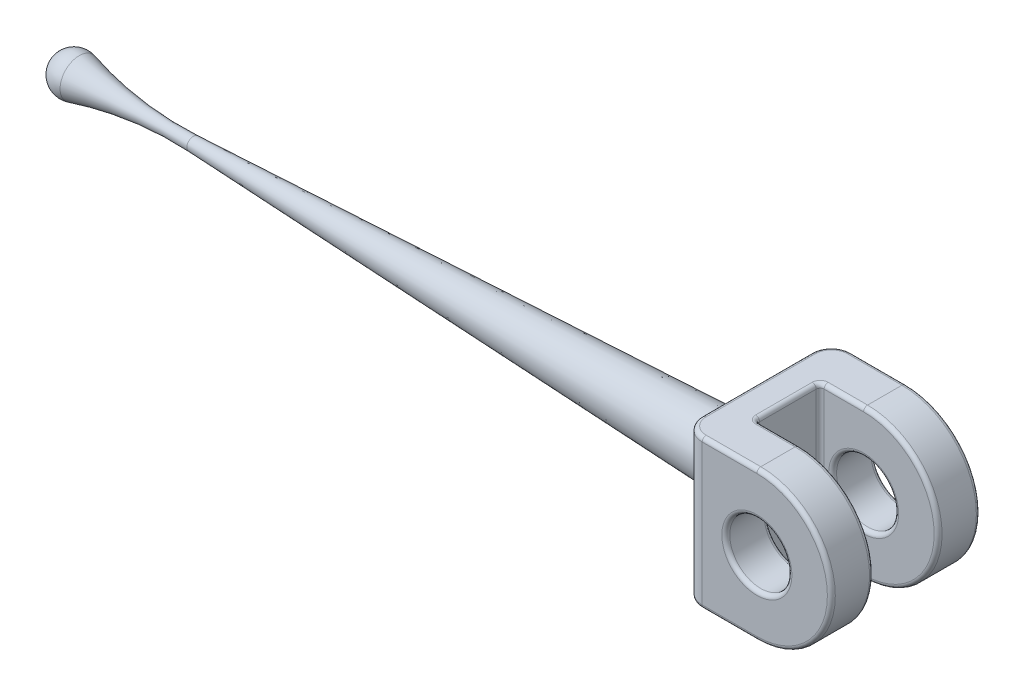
ISO-10303-21;
HEADER;
FILE_DESCRIPTION(('STEP AP214'),'2;1');
FILE_NAME('part.step','',(''),(''),'','','');
FILE_SCHEMA(('AUTOMOTIVE_DESIGN { 1 0 10303 214 1 1 1 1 }'));
ENDSEC;
DATA;
#1=APPLICATION_CONTEXT('core data for automotive mechanical design processes');
#2=APPLICATION_PROTOCOL_DEFINITION('international standard','automotive_design',2000,#1);
#3=PRODUCT_CONTEXT('',#1,'mechanical');
#4=PRODUCT('Part','Part','',(#3));
#5=PRODUCT_RELATED_PRODUCT_CATEGORY('part','',(#4));
#6=PRODUCT_DEFINITION_FORMATION('','',#4);
#7=PRODUCT_DEFINITION_CONTEXT('part definition',#1,'design');
#8=PRODUCT_DEFINITION('design','',#6,#7);
#9=PRODUCT_DEFINITION_SHAPE('','',#8);
#10=(LENGTH_UNIT() NAMED_UNIT(*) SI_UNIT(.MILLI.,.METRE.));
#11=(NAMED_UNIT(*) PLANE_ANGLE_UNIT() SI_UNIT($,.RADIAN.));
#12=(NAMED_UNIT(*) SI_UNIT($,.STERADIAN.) SOLID_ANGLE_UNIT());
#13=UNCERTAINTY_MEASURE_WITH_UNIT(LENGTH_MEASURE(1.E-05),#10,'distance_accuracy_value','');
#14=(GEOMETRIC_REPRESENTATION_CONTEXT(3) GLOBAL_UNCERTAINTY_ASSIGNED_CONTEXT((#13)) GLOBAL_UNIT_ASSIGNED_CONTEXT((#10,
#11,#12)) REPRESENTATION_CONTEXT('',''));
#15=CARTESIAN_POINT('',(0.,0.,0.));
#16=DIRECTION('',(0.,0.,1.));
#17=DIRECTION('',(1.,0.,0.));
#18=AXIS2_PLACEMENT_3D('',#15,#16,#17);
#19=CARTESIAN_POINT('',(0.,0.,7.62));
#20=DIRECTION('',(0.,0.,-1.));
#21=DIRECTION('',(-1.,0.,0.));
#22=AXIS2_PLACEMENT_3D('',#19,#20,#21);
#23=CYLINDRICAL_SURFACE('',#22,7.62);
#24=DIRECTION('',(0.,0.,-1.));
#25=VECTOR('',#24,1.);
#26=CARTESIAN_POINT('',(0.,7.62,7.62));
#27=LINE('',#26,#25);
#28=CARTESIAN_POINT('',(0.,7.62,7.2136));
#29=VERTEX_POINT('',#28);
#30=CARTESIAN_POINT('',(0.,7.62,3.7084));
#31=VERTEX_POINT('',#30);
#32=EDGE_CURVE('E217',#29,#31,#27,.T.);
#33=ORIENTED_EDGE('',*,*,#32,.F.);
#34=CARTESIAN_POINT('',(0.,0.,7.2136));
#35=DIRECTION('',(0.,0.,-1.));
#36=DIRECTION('',(-1.,0.,0.));
#37=AXIS2_PLACEMENT_3D('',#34,#35,#36);
#38=CIRCLE('',#37,7.62);
#39=CARTESIAN_POINT('',(0.,-7.62,7.2136));
#40=VERTEX_POINT('',#39);
#41=EDGE_CURVE('E330',#29,#40,#38,.T.);
#42=ORIENTED_EDGE('',*,*,#41,.T.);
#43=DIRECTION('',(0.,0.,-1.));
#44=VECTOR('',#43,1.);
#45=CARTESIAN_POINT('',(0.,-7.62,7.62));
#46=LINE('',#45,#44);
#47=CARTESIAN_POINT('',(0.,-7.62,3.7084));
#48=VERTEX_POINT('',#47);
#49=EDGE_CURVE('E458',#40,#48,#46,.T.);
#50=ORIENTED_EDGE('',*,*,#49,.T.);
#51=CARTESIAN_POINT('',(0.,0.,3.7084));
#52=DIRECTION('',(0.,0.,1.));
#53=DIRECTION('',(1.,0.,0.));
#54=AXIS2_PLACEMENT_3D('',#51,#52,#53);
#55=CIRCLE('',#54,7.62);
#56=EDGE_CURVE('E328',#48,#31,#55,.T.);
#57=ORIENTED_EDGE('',*,*,#56,.T.);
#58=EDGE_LOOP('',(#33,#42,#50,#57));
#59=FACE_BOUND('',#58,.T.);
#60=ADVANCED_FACE('F33',(#59),#23,.T.);
#61=CARTESIAN_POINT('',(0.,0.,7.62));
#62=DIRECTION('',(0.,0.,-1.));
#63=DIRECTION('',(-1.,0.,0.));
#64=AXIS2_PLACEMENT_3D('',#61,#62,#63);
#65=CYLINDRICAL_SURFACE('',#64,3.175);
#66=CARTESIAN_POINT('',(0.,0.,3.7084));
#67=DIRECTION('',(0.,0.,1.));
#68=DIRECTION('',(1.,0.,0.));
#69=AXIS2_PLACEMENT_3D('',#66,#67,#68);
#70=CIRCLE('',#69,3.175);
#71=CARTESIAN_POINT('',(-3.175,0.,3.7084));
#72=VERTEX_POINT('',#71);
#73=EDGE_CURVE('E344',#72,#72,#70,.F.);
#74=CARTESIAN_POINT('',(0.,0.,7.2136));
#75=DIRECTION('',(0.,0.,-1.));
#76=DIRECTION('',(-1.,0.,0.));
#77=AXIS2_PLACEMENT_3D('',#74,#75,#76);
#78=CIRCLE('',#77,3.175);
#79=CARTESIAN_POINT('',(-3.175,0.,7.2136));
#80=VERTEX_POINT('',#79);
#81=EDGE_CURVE('E341',#80,#80,#78,.F.);
#82=CARTESIAN_POINT('',(-3.175,0.,3.7084));
#83=CARTESIAN_POINT('',(-3.175,0.,3.7449125));
#84=CARTESIAN_POINT('',(-3.175,0.,3.781425));
#85=CARTESIAN_POINT('',(-3.175,0.,3.85445));
#86=CARTESIAN_POINT('',(-3.175,0.,3.8909625));
#87=CARTESIAN_POINT('',(-3.175,0.,3.9639875));
#88=CARTESIAN_POINT('',(-3.175,0.,4.0005));
#89=CARTESIAN_POINT('',(-3.175,0.,4.073525));
#90=CARTESIAN_POINT('',(-3.175,0.,4.1100375));
#91=CARTESIAN_POINT('',(-3.175,0.,4.1830625));
#92=CARTESIAN_POINT('',(-3.175,0.,4.219575));
#93=CARTESIAN_POINT('',(-3.175,0.,4.2926));
#94=CARTESIAN_POINT('',(-3.175,0.,4.3291125));
#95=CARTESIAN_POINT('',(-3.175,0.,4.4021375));
#96=CARTESIAN_POINT('',(-3.175,0.,4.43865));
#97=CARTESIAN_POINT('',(-3.175,0.,4.511675));
#98=CARTESIAN_POINT('',(-3.175,0.,4.5481875));
#99=CARTESIAN_POINT('',(-3.175,0.,4.6212125));
#100=CARTESIAN_POINT('',(-3.175,0.,4.657725));
#101=CARTESIAN_POINT('',(-3.175,0.,4.73075));
#102=CARTESIAN_POINT('',(-3.175,0.,4.7672625));
#103=CARTESIAN_POINT('',(-3.175,0.,4.8402875));
#104=CARTESIAN_POINT('',(-3.175,0.,4.8768));
#105=CARTESIAN_POINT('',(-3.175,0.,4.949825));
#106=CARTESIAN_POINT('',(-3.175,0.,4.9863375));
#107=CARTESIAN_POINT('',(-3.175,0.,5.0593625));
#108=CARTESIAN_POINT('',(-3.175,0.,5.095875));
#109=CARTESIAN_POINT('',(-3.175,0.,5.1689));
#110=CARTESIAN_POINT('',(-3.175,0.,5.2054125));
#111=CARTESIAN_POINT('',(-3.175,0.,5.2784375));
#112=CARTESIAN_POINT('',(-3.175,0.,5.31495));
#113=CARTESIAN_POINT('',(-3.175,0.,5.387975));
#114=CARTESIAN_POINT('',(-3.175,0.,5.4244875));
#115=CARTESIAN_POINT('',(-3.175,0.,5.4975125));
#116=CARTESIAN_POINT('',(-3.175,0.,5.534025));
#117=CARTESIAN_POINT('',(-3.175,0.,5.60705));
#118=CARTESIAN_POINT('',(-3.175,0.,5.6435625));
#119=CARTESIAN_POINT('',(-3.175,0.,5.7165875));
#120=CARTESIAN_POINT('',(-3.175,0.,5.7531));
#121=CARTESIAN_POINT('',(-3.175,0.,5.826125));
#122=CARTESIAN_POINT('',(-3.175,0.,5.8626375));
#123=CARTESIAN_POINT('',(-3.175,0.,5.9356625));
#124=CARTESIAN_POINT('',(-3.175,0.,5.972175));
#125=CARTESIAN_POINT('',(-3.175,0.,6.0452));
#126=CARTESIAN_POINT('',(-3.175,0.,6.0817125));
#127=CARTESIAN_POINT('',(-3.175,0.,6.1547375));
#128=CARTESIAN_POINT('',(-3.175,0.,6.19125));
#129=CARTESIAN_POINT('',(-3.175,0.,6.264275));
#130=CARTESIAN_POINT('',(-3.175,0.,6.3007875));
#131=CARTESIAN_POINT('',(-3.175,0.,6.3738125));
#132=CARTESIAN_POINT('',(-3.175,0.,6.410325));
#133=CARTESIAN_POINT('',(-3.175,0.,6.48335));
#134=CARTESIAN_POINT('',(-3.175,0.,6.5198625));
#135=CARTESIAN_POINT('',(-3.175,0.,6.5928875));
#136=CARTESIAN_POINT('',(-3.175,0.,6.6294));
#137=CARTESIAN_POINT('',(-3.175,0.,6.702425));
#138=CARTESIAN_POINT('',(-3.175,0.,6.7389375));
#139=CARTESIAN_POINT('',(-3.175,0.,6.8119625));
#140=CARTESIAN_POINT('',(-3.175,0.,6.848475));
#141=CARTESIAN_POINT('',(-3.175,0.,6.9215));
#142=CARTESIAN_POINT('',(-3.175,0.,6.9580125));
#143=CARTESIAN_POINT('',(-3.175,0.,7.0310375));
#144=CARTESIAN_POINT('',(-3.175,0.,7.06755));
#145=CARTESIAN_POINT('',(-3.175,0.,7.140575));
#146=CARTESIAN_POINT('',(-3.175,0.,7.1770875));
#147=CARTESIAN_POINT('',(-3.175,0.,7.2136));
#148=B_SPLINE_CURVE_WITH_KNOTS('',3,(#82,#83,#84,#85,#86,#87,#88,#89,#90,#91,#92,#93,#94,#95,
#96,#97,#98,#99,#100,#101,#102,#103,#104,#105,#106,#107,#108,#109,#110,#111,#112,#113,#114,#115,
#116,#117,#118,#119,#120,#121,#122,#123,#124,#125,#126,#127,#128,#129,#130,#131,#132,#133,#134,
#135,#136,#137,#138,#139,#140,#141,#142,#143,#144,#145,#146,#147),.UNSPECIFIED.,.F.,.F.,(4,2,2,
2,2,2,2,2,2,2,2,2,2,2,2,2,2,2,2,2,2,2,2,2,2,2,2,2,2,2,2,2,4),(0.,0.1095375,0.219074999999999,
0.3286125,0.43815,0.5476875,0.657224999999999,0.7667625,0.8763,0.9858375,1.095375,1.2049125,
1.31445,1.4239875,1.533525,1.6430625,1.7526,1.8621375,1.971675,2.0812125,2.19075,2.3002875,
2.409825,2.5193625,2.6289,2.7384375,2.847975,2.9575125,3.06705,3.1765875,3.286125,3.3956625,
3.5052),.UNSPECIFIED.);
#149=EDGE_CURVE('BSEAM486',#72,#80,#148,.T.);
#150=ORIENTED_EDGE('',*,*,#73,.T.);
#151=ORIENTED_EDGE('',*,*,#81,.T.);
#152=ORIENTED_EDGE('',*,*,#149,.T.);
#153=ORIENTED_EDGE('',*,*,#149,.F.);
#154=EDGE_LOOP('',(#150,#152,#151,#153));
#155=FACE_BOUND('',#154,.T.);
#156=ADVANCED_FACE('F486',(#155),#65,.F.);
#157=CARTESIAN_POINT('',(0.,0.,7.62));
#158=DIRECTION('',(0.,0.,-1.));
#159=DIRECTION('',(-1.,0.,0.));
#160=AXIS2_PLACEMENT_3D('',#157,#158,#159);
#161=PLANE('',#160);
#162=CARTESIAN_POINT('',(0.,0.,7.62));
#163=DIRECTION('',(0.,0.,-1.));
#164=DIRECTION('',(-1.,0.,0.));
#165=AXIS2_PLACEMENT_3D('',#162,#163,#164);
#166=CIRCLE('',#165,3.5814);
#167=CARTESIAN_POINT('',(-3.5814,0.,7.62));
#168=VERTEX_POINT('',#167);
#169=EDGE_CURVE('E319',#168,#168,#166,.T.);
#170=ORIENTED_EDGE('',*,*,#169,.T.);
#171=EDGE_LOOP('',(#170));
#172=FACE_BOUND('',#171,.T.);
#173=CARTESIAN_POINT('',(0.,0.,7.62));
#174=DIRECTION('',(0.,0.,-1.));
#175=DIRECTION('',(-1.,0.,0.));
#176=AXIS2_PLACEMENT_3D('',#173,#174,#175);
#177=CIRCLE('',#176,7.2136);
#178=CARTESIAN_POINT('',(0.,-7.2136,7.62));
#179=VERTEX_POINT('',#178);
#180=CARTESIAN_POINT('',(0.,7.2136,7.62));
#181=VERTEX_POINT('',#180);
#182=EDGE_CURVE('E324',#179,#181,#177,.F.);
#183=ORIENTED_EDGE('',*,*,#182,.T.);
#184=DIRECTION('',(-1.,0.,0.));
#185=VECTOR('',#184,1.);
#186=CARTESIAN_POINT('',(0.,7.2136,7.62));
#187=LINE('',#186,#185);
#188=CARTESIAN_POINT('',(-5.588,7.2136,7.62));
#189=VERTEX_POINT('',#188);
#190=EDGE_CURVE('E326',#181,#189,#187,.T.);
#191=ORIENTED_EDGE('',*,*,#190,.T.);
#192=DIRECTION('',(0.,-1.,0.));
#193=VECTOR('',#192,1.);
#194=CARTESIAN_POINT('',(-5.588,0.,7.62));
#195=LINE('',#194,#193);
#196=CARTESIAN_POINT('',(-5.588,-7.2136,7.62));
#197=VERTEX_POINT('',#196);
#198=EDGE_CURVE('E236',#189,#197,#195,.T.);
#199=ORIENTED_EDGE('',*,*,#198,.T.);
#200=DIRECTION('',(1.,0.,0.));
#201=VECTOR('',#200,1.);
#202=CARTESIAN_POINT('',(0.,-7.2136,7.62));
#203=LINE('',#202,#201);
#204=EDGE_CURVE('E322',#197,#179,#203,.T.);
#205=ORIENTED_EDGE('',*,*,#204,.T.);
#206=EDGE_LOOP('',(#183,#191,#199,#205));
#207=FACE_BOUND('',#206,.T.);
#208=ADVANCED_FACE('F492',(#172,#207),#161,.F.);
#209=CARTESIAN_POINT('',(0.,0.,-7.62));
#210=DIRECTION('',(0.,0.,-1.));
#211=DIRECTION('',(-1.,0.,0.));
#212=AXIS2_PLACEMENT_3D('',#209,#210,#211);
#213=PLANE('',#212);
#214=CARTESIAN_POINT('',(0.,0.,-7.62));
#215=DIRECTION('',(0.,0.,-1.));
#216=DIRECTION('',(-1.,0.,0.));
#217=AXIS2_PLACEMENT_3D('',#214,#215,#216);
#218=CIRCLE('',#217,3.5814);
#219=CARTESIAN_POINT('',(-3.5814,0.,-7.62));
#220=VERTEX_POINT('',#219);
#221=EDGE_CURVE('E310',#220,#220,#218,.F.);
#222=ORIENTED_EDGE('',*,*,#221,.T.);
#223=EDGE_LOOP('',(#222));
#224=FACE_BOUND('',#223,.T.);
#225=CARTESIAN_POINT('',(0.,0.,-7.62));
#226=DIRECTION('',(0.,0.,-1.));
#227=DIRECTION('',(-1.,0.,0.));
#228=AXIS2_PLACEMENT_3D('',#225,#226,#227);
#229=CIRCLE('',#228,7.2136);
#230=CARTESIAN_POINT('',(0.,7.2136,-7.62));
#231=VERTEX_POINT('',#230);
#232=CARTESIAN_POINT('',(0.,-7.2136,-7.62));
#233=VERTEX_POINT('',#232);
#234=EDGE_CURVE('E315',#231,#233,#229,.T.);
#235=ORIENTED_EDGE('',*,*,#234,.T.);
#236=DIRECTION('',(1.,0.,0.));
#237=VECTOR('',#236,1.);
#238=CARTESIAN_POINT('',(-5.588,-7.2136,-7.62));
#239=LINE('',#238,#237);
#240=CARTESIAN_POINT('',(-5.588,-7.2136,-7.62));
#241=VERTEX_POINT('',#240);
#242=EDGE_CURVE('E317',#233,#241,#239,.F.);
#243=ORIENTED_EDGE('',*,*,#242,.T.);
#244=DIRECTION('',(0.,-1.,0.));
#245=VECTOR('',#244,1.);
#246=CARTESIAN_POINT('',(-5.588,7.62,-7.62));
#247=LINE('',#246,#245);
#248=CARTESIAN_POINT('',(-5.588,7.2136,-7.62));
#249=VERTEX_POINT('',#248);
#250=EDGE_CURVE('E437',#241,#249,#247,.F.);
#251=ORIENTED_EDGE('',*,*,#250,.T.);
#252=DIRECTION('',(-1.,0.,0.));
#253=VECTOR('',#252,1.);
#254=CARTESIAN_POINT('',(0.,7.2136,-7.62));
#255=LINE('',#254,#253);
#256=EDGE_CURVE('E313',#249,#231,#255,.F.);
#257=ORIENTED_EDGE('',*,*,#256,.T.);
#258=EDGE_LOOP('',(#235,#243,#251,#257));
#259=FACE_BOUND('',#258,.T.);
#260=ADVANCED_FACE('F442',(#224,#259),#213,.T.);
#261=CARTESIAN_POINT('',(-7.62,-7.62,7.62));
#262=DIRECTION('',(1.,0.,0.));
#263=DIRECTION('',(0.,0.,-1.));
#264=AXIS2_PLACEMENT_3D('',#261,#262,#263);
#265=PLANE('',#264);
#266=CARTESIAN_POINT('',(-7.62,0.,0.));
#267=DIRECTION('',(1.,0.,0.));
#268=DIRECTION('',(0.,0.,-1.));
#269=AXIS2_PLACEMENT_3D('',#266,#267,#268);
#270=CIRCLE('',#269,5.12021682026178);
#271=CARTESIAN_POINT('',(-7.62,0.,-5.12021682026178));
#272=VERTEX_POINT('',#271);
#273=EDGE_CURVE('E449',#272,#272,#270,.T.);
#274=ORIENTED_EDGE('',*,*,#273,.T.);
#275=EDGE_LOOP('',(#274));
#276=FACE_BOUND('',#275,.T.);
#277=DIRECTION('',(0.,-1.,0.));
#278=VECTOR('',#277,1.);
#279=CARTESIAN_POINT('',(-7.62,-7.62,-5.588));
#280=LINE('',#279,#278);
#281=CARTESIAN_POINT('',(-7.62,7.2136,-5.588));
#282=VERTEX_POINT('',#281);
#283=CARTESIAN_POINT('',(-7.62,-7.2136,-5.588));
#284=VERTEX_POINT('',#283);
#285=EDGE_CURVE('E440',#282,#284,#280,.T.);
#286=ORIENTED_EDGE('',*,*,#285,.T.);
#287=DIRECTION('',(0.,0.,-1.));
#288=VECTOR('',#287,1.);
#289=CARTESIAN_POINT('',(-7.62,-7.2136,7.62));
#290=LINE('',#289,#288);
#291=CARTESIAN_POINT('',(-7.62,-7.2136,5.588));
#292=VERTEX_POINT('',#291);
#293=EDGE_CURVE('E304',#284,#292,#290,.F.);
#294=ORIENTED_EDGE('',*,*,#293,.T.);
#295=DIRECTION('',(0.,-1.,0.));
#296=VECTOR('',#295,1.);
#297=CARTESIAN_POINT('',(-7.62,-7.62,5.588));
#298=LINE('',#297,#296);
#299=CARTESIAN_POINT('',(-7.62,7.2136,5.588));
#300=VERTEX_POINT('',#299);
#301=EDGE_CURVE('E455',#292,#300,#298,.F.);
#302=ORIENTED_EDGE('',*,*,#301,.T.);
#303=DIRECTION('',(0.,0.,-1.));
#304=VECTOR('',#303,1.);
#305=CARTESIAN_POINT('',(-7.62,7.2136,7.62));
#306=LINE('',#305,#304);
#307=EDGE_CURVE('E302',#300,#282,#306,.T.);
#308=ORIENTED_EDGE('',*,*,#307,.T.);
#309=EDGE_LOOP('',(#286,#294,#302,#308));
#310=FACE_BOUND('',#309,.T.);
#311=ADVANCED_FACE('F504',(#276,#310),#265,.F.);
#312=CARTESIAN_POINT('',(0.,-7.62,7.62));
#313=DIRECTION('',(0.,1.,0.));
#314=DIRECTION('',(-1.,0.,0.));
#315=AXIS2_PLACEMENT_3D('',#312,#313,#314);
#316=PLANE('',#315);
#317=CARTESIAN_POINT('',(0.,-7.62,-3.7084));
#318=VERTEX_POINT('',#317);
#319=CARTESIAN_POINT('',(0.,-7.62,-7.2136));
#320=VERTEX_POINT('',#319);
#321=EDGE_CURVE('E460',#318,#320,#46,.T.);
#322=ORIENTED_EDGE('',*,*,#321,.F.);
#323=DIRECTION('',(-1.,0.,0.));
#324=VECTOR('',#323,1.);
#325=CARTESIAN_POINT('',(0.,-7.62,-3.7084));
#326=LINE('',#325,#324);
#327=CARTESIAN_POINT('',(-4.0386,-7.62,-3.7084));
#328=VERTEX_POINT('',#327);
#329=EDGE_CURVE('E269',#318,#328,#326,.T.);
#330=ORIENTED_EDGE('',*,*,#329,.T.);
#331=CARTESIAN_POINT('',(-4.0386,-7.62,-2.8956));
#332=DIRECTION('',(0.,1.,0.));
#333=DIRECTION('',(-1.,0.,0.));
#334=AXIS2_PLACEMENT_3D('',#331,#332,#333);
#335=CIRCLE('',#334,0.8128);
#336=CARTESIAN_POINT('',(-4.8514,-7.62,-2.8956));
#337=VERTEX_POINT('',#336);
#338=EDGE_CURVE('E266',#337,#328,#335,.F.);
#339=ORIENTED_EDGE('',*,*,#338,.F.);
#340=DIRECTION('',(0.,0.,1.));
#341=VECTOR('',#340,1.);
#342=CARTESIAN_POINT('',(-4.8514,-7.62,7.62));
#343=LINE('',#342,#341);
#344=CARTESIAN_POINT('',(-4.8514,-7.62,2.8956));
#345=VERTEX_POINT('',#344);
#346=EDGE_CURVE('E264',#337,#345,#343,.T.);
#347=ORIENTED_EDGE('',*,*,#346,.T.);
#348=CARTESIAN_POINT('',(-4.0386,-7.62,2.8956));
#349=DIRECTION('',(0.,1.,0.));
#350=DIRECTION('',(-1.,0.,0.));
#351=AXIS2_PLACEMENT_3D('',#348,#349,#350);
#352=CIRCLE('',#351,0.8128);
#353=CARTESIAN_POINT('',(-4.0386,-7.62,3.7084));
#354=VERTEX_POINT('',#353);
#355=EDGE_CURVE('E261',#354,#345,#352,.F.);
#356=ORIENTED_EDGE('',*,*,#355,.F.);
#357=DIRECTION('',(1.,0.,0.));
#358=VECTOR('',#357,1.);
#359=CARTESIAN_POINT('',(0.,-7.62,3.7084));
#360=LINE('',#359,#358);
#361=EDGE_CURVE('E259',#354,#48,#360,.T.);
#362=ORIENTED_EDGE('',*,*,#361,.T.);
#363=ORIENTED_EDGE('',*,*,#49,.F.);
#364=DIRECTION('',(1.,0.,0.));
#365=VECTOR('',#364,1.);
#366=CARTESIAN_POINT('',(0.,-7.62,7.2136));
#367=LINE('',#366,#365);
#368=CARTESIAN_POINT('',(-5.588,-7.62,7.2136));
#369=VERTEX_POINT('',#368);
#370=EDGE_CURVE('E248',#40,#369,#367,.F.);
#371=ORIENTED_EDGE('',*,*,#370,.T.);
#372=CARTESIAN_POINT('',(-5.588,-7.62,5.588));
#373=DIRECTION('',(0.,1.,0.));
#374=DIRECTION('',(-1.,0.,0.));
#375=AXIS2_PLACEMENT_3D('',#372,#373,#374);
#376=CIRCLE('',#375,1.6256);
#377=CARTESIAN_POINT('',(-7.2136,-7.62,5.588));
#378=VERTEX_POINT('',#377);
#379=EDGE_CURVE('E250',#369,#378,#376,.F.);
#380=ORIENTED_EDGE('',*,*,#379,.T.);
#381=DIRECTION('',(0.,0.,-1.));
#382=VECTOR('',#381,1.);
#383=CARTESIAN_POINT('',(-7.2136,-7.62,7.62));
#384=LINE('',#383,#382);
#385=CARTESIAN_POINT('',(-7.2136,-7.62,-5.588));
#386=VERTEX_POINT('',#385);
#387=EDGE_CURVE('E253',#378,#386,#384,.T.);
#388=ORIENTED_EDGE('',*,*,#387,.T.);
#389=CARTESIAN_POINT('',(-5.588,-7.62,-5.588));
#390=DIRECTION('',(0.,1.,0.));
#391=DIRECTION('',(-1.,0.,0.));
#392=AXIS2_PLACEMENT_3D('',#389,#390,#391);
#393=CIRCLE('',#392,1.6256);
#394=CARTESIAN_POINT('',(-5.588,-7.62,-7.2136));
#395=VERTEX_POINT('',#394);
#396=EDGE_CURVE('E255',#386,#395,#393,.F.);
#397=ORIENTED_EDGE('',*,*,#396,.T.);
#398=DIRECTION('',(1.,0.,0.));
#399=VECTOR('',#398,1.);
#400=CARTESIAN_POINT('',(0.,-7.62,-7.2136));
#401=LINE('',#400,#399);
#402=EDGE_CURVE('E257',#395,#320,#401,.T.);
#403=ORIENTED_EDGE('',*,*,#402,.T.);
#404=EDGE_LOOP('',(#322,#330,#339,#347,#356,#362,#363,#371,#380,#388,#397,#403));
#405=FACE_BOUND('',#404,.T.);
#406=ADVANCED_FACE('F499',(#405),#316,.F.);
#407=CARTESIAN_POINT('',(0.,7.62,-3.7084));
#408=VERTEX_POINT('',#407);
#409=CARTESIAN_POINT('',(0.,7.62,-7.2136));
#410=VERTEX_POINT('',#409);
#411=EDGE_CURVE('E198',#408,#410,#27,.T.);
#412=ORIENTED_EDGE('',*,*,#411,.F.);
#413=CARTESIAN_POINT('',(0.,0.,-3.7084));
#414=DIRECTION('',(0.,0.,-1.));
#415=DIRECTION('',(-1.,0.,0.));
#416=AXIS2_PLACEMENT_3D('',#413,#414,#415);
#417=CIRCLE('',#416,7.62);
#418=EDGE_CURVE('E213',#408,#318,#417,.T.);
#419=ORIENTED_EDGE('',*,*,#418,.T.);
#420=ORIENTED_EDGE('',*,*,#321,.T.);
#421=CARTESIAN_POINT('',(0.,0.,-7.2136));
#422=DIRECTION('',(0.,0.,-1.));
#423=DIRECTION('',(-1.,0.,0.));
#424=AXIS2_PLACEMENT_3D('',#421,#422,#423);
#425=CIRCLE('',#424,7.62);
#426=EDGE_CURVE('E216',#320,#410,#425,.F.);
#427=ORIENTED_EDGE('',*,*,#426,.T.);
#428=EDGE_LOOP('',(#412,#419,#420,#427));
#429=FACE_BOUND('',#428,.T.);
#430=ADVANCED_FACE('F210',(#429),#23,.T.);
#431=CARTESIAN_POINT('',(0.,7.62,7.62));
#432=DIRECTION('',(0.,-1.,0.));
#433=DIRECTION('',(1.,0.,0.));
#434=AXIS2_PLACEMENT_3D('',#431,#432,#433);
#435=PLANE('',#434);
#436=ORIENTED_EDGE('',*,*,#411,.T.);
#437=DIRECTION('',(-1.,0.,0.));
#438=VECTOR('',#437,1.);
#439=CARTESIAN_POINT('',(-5.588,7.62,-7.2136));
#440=LINE('',#439,#438);
#441=CARTESIAN_POINT('',(-5.588,7.62,-7.2136));
#442=VERTEX_POINT('',#441);
#443=EDGE_CURVE('E286',#410,#442,#440,.T.);
#444=ORIENTED_EDGE('',*,*,#443,.T.);
#445=CARTESIAN_POINT('',(-5.588,7.62,-5.588));
#446=DIRECTION('',(0.,-1.,0.));
#447=DIRECTION('',(1.,0.,0.));
#448=AXIS2_PLACEMENT_3D('',#445,#446,#447);
#449=CIRCLE('',#448,1.6256);
#450=CARTESIAN_POINT('',(-7.2136,7.62,-5.588));
#451=VERTEX_POINT('',#450);
#452=EDGE_CURVE('E284',#442,#451,#449,.F.);
#453=ORIENTED_EDGE('',*,*,#452,.T.);
#454=DIRECTION('',(0.,0.,-1.));
#455=VECTOR('',#454,1.);
#456=CARTESIAN_POINT('',(-7.2136,7.62,7.62));
#457=LINE('',#456,#455);
#458=CARTESIAN_POINT('',(-7.2136,7.62,5.588));
#459=VERTEX_POINT('',#458);
#460=EDGE_CURVE('E282',#451,#459,#457,.F.);
#461=ORIENTED_EDGE('',*,*,#460,.T.);
#462=CARTESIAN_POINT('',(-5.588,7.62,5.588));
#463=DIRECTION('',(0.,-1.,0.));
#464=DIRECTION('',(1.,0.,0.));
#465=AXIS2_PLACEMENT_3D('',#462,#463,#464);
#466=CIRCLE('',#465,1.6256);
#467=CARTESIAN_POINT('',(-5.588,7.62,7.2136));
#468=VERTEX_POINT('',#467);
#469=EDGE_CURVE('E280',#459,#468,#466,.F.);
#470=ORIENTED_EDGE('',*,*,#469,.T.);
#471=DIRECTION('',(-1.,0.,0.));
#472=VECTOR('',#471,1.);
#473=CARTESIAN_POINT('',(0.,7.62,7.2136));
#474=LINE('',#473,#472);
#475=EDGE_CURVE('E206',#468,#29,#474,.F.);
#476=ORIENTED_EDGE('',*,*,#475,.T.);
#477=ORIENTED_EDGE('',*,*,#32,.T.);
#478=DIRECTION('',(1.,0.,0.));
#479=VECTOR('',#478,1.);
#480=CARTESIAN_POINT('',(0.,7.62,3.7084));
#481=LINE('',#480,#479);
#482=CARTESIAN_POINT('',(-4.0386,7.62,3.7084));
#483=VERTEX_POINT('',#482);
#484=EDGE_CURVE('E274',#31,#483,#481,.F.);
#485=ORIENTED_EDGE('',*,*,#484,.T.);
#486=CARTESIAN_POINT('',(-4.0386,7.62,2.8956));
#487=DIRECTION('',(0.,-1.,0.));
#488=DIRECTION('',(1.,0.,0.));
#489=AXIS2_PLACEMENT_3D('',#486,#487,#488);
#490=CIRCLE('',#489,0.8128);
#491=CARTESIAN_POINT('',(-4.8514,7.62,2.8956));
#492=VERTEX_POINT('',#491);
#493=EDGE_CURVE('E271',#492,#483,#490,.F.);
#494=ORIENTED_EDGE('',*,*,#493,.F.);
#495=DIRECTION('',(0.,0.,1.));
#496=VECTOR('',#495,1.);
#497=CARTESIAN_POINT('',(-4.8514,7.62,7.62));
#498=LINE('',#497,#496);
#499=CARTESIAN_POINT('',(-4.8514,7.62,-2.8956));
#500=VERTEX_POINT('',#499);
#501=EDGE_CURVE('E276',#492,#500,#498,.F.);
#502=ORIENTED_EDGE('',*,*,#501,.T.);
#503=CARTESIAN_POINT('',(-4.0386,7.62,-2.8956));
#504=DIRECTION('',(0.,-1.,0.));
#505=DIRECTION('',(1.,0.,0.));
#506=AXIS2_PLACEMENT_3D('',#503,#504,#505);
#507=CIRCLE('',#506,0.8128);
#508=CARTESIAN_POINT('',(-4.0386,7.62,-3.7084));
#509=VERTEX_POINT('',#508);
#510=EDGE_CURVE('E201',#509,#500,#507,.F.);
#511=ORIENTED_EDGE('',*,*,#510,.F.);
#512=DIRECTION('',(-1.,0.,0.));
#513=VECTOR('',#512,1.);
#514=CARTESIAN_POINT('',(0.,7.62,-3.7084));
#515=LINE('',#514,#513);
#516=EDGE_CURVE('E195',#509,#408,#515,.F.);
#517=ORIENTED_EDGE('',*,*,#516,.T.);
#518=EDGE_LOOP('',(#436,#444,#453,#461,#470,#476,#477,#485,#494,#502,#511,#517));
#519=FACE_BOUND('',#518,.T.);
#520=ADVANCED_FACE('F197',(#519),#435,.F.);
#521=CARTESIAN_POINT('',(0.,0.,-3.7084));
#522=DIRECTION('',(0.,0.,-1.));
#523=DIRECTION('',(-1.,0.,0.));
#524=AXIS2_PLACEMENT_3D('',#521,#522,#523);
#525=CIRCLE('',#524,3.175);
#526=CARTESIAN_POINT('',(-3.175,0.,-3.7084));
#527=VERTEX_POINT('',#526);
#528=EDGE_CURVE('E11',#527,#527,#525,.F.);
#529=CARTESIAN_POINT('',(0.,0.,-7.2136));
#530=DIRECTION('',(0.,0.,-1.));
#531=DIRECTION('',(-1.,0.,0.));
#532=AXIS2_PLACEMENT_3D('',#529,#530,#531);
#533=CIRCLE('',#532,3.175);
#534=CARTESIAN_POINT('',(-3.175,0.,-7.2136));
#535=VERTEX_POINT('',#534);
#536=EDGE_CURVE('E42',#535,#535,#533,.T.);
#537=CARTESIAN_POINT('',(-3.175,0.,-3.7084));
#538=CARTESIAN_POINT('',(-3.175,0.,-3.7449125));
#539=CARTESIAN_POINT('',(-3.175,0.,-3.781425));
#540=CARTESIAN_POINT('',(-3.175,0.,-3.85445));
#541=CARTESIAN_POINT('',(-3.175,0.,-3.8909625));
#542=CARTESIAN_POINT('',(-3.175,0.,-3.9639875));
#543=CARTESIAN_POINT('',(-3.175,0.,-4.0005));
#544=CARTESIAN_POINT('',(-3.175,0.,-4.073525));
#545=CARTESIAN_POINT('',(-3.175,0.,-4.1100375));
#546=CARTESIAN_POINT('',(-3.175,0.,-4.1830625));
#547=CARTESIAN_POINT('',(-3.175,0.,-4.219575));
#548=CARTESIAN_POINT('',(-3.175,0.,-4.2926));
#549=CARTESIAN_POINT('',(-3.175,0.,-4.3291125));
#550=CARTESIAN_POINT('',(-3.175,0.,-4.4021375));
#551=CARTESIAN_POINT('',(-3.175,0.,-4.43865));
#552=CARTESIAN_POINT('',(-3.175,0.,-4.511675));
#553=CARTESIAN_POINT('',(-3.175,0.,-4.5481875));
#554=CARTESIAN_POINT('',(-3.175,0.,-4.6212125));
#555=CARTESIAN_POINT('',(-3.175,0.,-4.657725));
#556=CARTESIAN_POINT('',(-3.175,0.,-4.73075));
#557=CARTESIAN_POINT('',(-3.175,0.,-4.7672625));
#558=CARTESIAN_POINT('',(-3.175,0.,-4.8402875));
#559=CARTESIAN_POINT('',(-3.175,0.,-4.8768));
#560=CARTESIAN_POINT('',(-3.175,0.,-4.949825));
#561=CARTESIAN_POINT('',(-3.175,0.,-4.9863375));
#562=CARTESIAN_POINT('',(-3.175,0.,-5.0593625));
#563=CARTESIAN_POINT('',(-3.175,0.,-5.095875));
#564=CARTESIAN_POINT('',(-3.175,0.,-5.1689));
#565=CARTESIAN_POINT('',(-3.175,0.,-5.2054125));
#566=CARTESIAN_POINT('',(-3.175,0.,-5.2784375));
#567=CARTESIAN_POINT('',(-3.175,0.,-5.31495));
#568=CARTESIAN_POINT('',(-3.175,0.,-5.387975));
#569=CARTESIAN_POINT('',(-3.175,0.,-5.4244875));
#570=CARTESIAN_POINT('',(-3.175,0.,-5.4975125));
#571=CARTESIAN_POINT('',(-3.175,0.,-5.534025));
#572=CARTESIAN_POINT('',(-3.175,0.,-5.60705));
#573=CARTESIAN_POINT('',(-3.175,0.,-5.6435625));
#574=CARTESIAN_POINT('',(-3.175,0.,-5.7165875));
#575=CARTESIAN_POINT('',(-3.175,0.,-5.7531));
#576=CARTESIAN_POINT('',(-3.175,0.,-5.826125));
#577=CARTESIAN_POINT('',(-3.175,0.,-5.8626375));
#578=CARTESIAN_POINT('',(-3.175,0.,-5.9356625));
#579=CARTESIAN_POINT('',(-3.175,0.,-5.972175));
#580=CARTESIAN_POINT('',(-3.175,0.,-6.0452));
#581=CARTESIAN_POINT('',(-3.175,0.,-6.0817125));
#582=CARTESIAN_POINT('',(-3.175,0.,-6.1547375));
#583=CARTESIAN_POINT('',(-3.175,0.,-6.19125));
#584=CARTESIAN_POINT('',(-3.175,0.,-6.264275));
#585=CARTESIAN_POINT('',(-3.175,0.,-6.3007875));
#586=CARTESIAN_POINT('',(-3.175,0.,-6.3738125));
#587=CARTESIAN_POINT('',(-3.175,0.,-6.410325));
#588=CARTESIAN_POINT('',(-3.175,0.,-6.48335));
#589=CARTESIAN_POINT('',(-3.175,0.,-6.5198625));
#590=CARTESIAN_POINT('',(-3.175,0.,-6.5928875));
#591=CARTESIAN_POINT('',(-3.175,0.,-6.6294));
#592=CARTESIAN_POINT('',(-3.175,0.,-6.702425));
#593=CARTESIAN_POINT('',(-3.175,0.,-6.7389375));
#594=CARTESIAN_POINT('',(-3.175,0.,-6.8119625));
#595=CARTESIAN_POINT('',(-3.175,0.,-6.848475));
#596=CARTESIAN_POINT('',(-3.175,0.,-6.9215));
#597=CARTESIAN_POINT('',(-3.175,0.,-6.9580125));
#598=CARTESIAN_POINT('',(-3.175,0.,-7.0310375));
#599=CARTESIAN_POINT('',(-3.175,0.,-7.06755));
#600=CARTESIAN_POINT('',(-3.175,0.,-7.140575));
#601=CARTESIAN_POINT('',(-3.175,0.,-7.1770875));
#602=CARTESIAN_POINT('',(-3.175,0.,-7.2136));
#603=B_SPLINE_CURVE_WITH_KNOTS('',3,(#537,#538,#539,#540,#541,#542,#543,#544,#545,#546,#547,
#548,#549,#550,#551,#552,#553,#554,#555,#556,#557,#558,#559,#560,#561,#562,#563,#564,#565,#566,
#567,#568,#569,#570,#571,#572,#573,#574,#575,#576,#577,#578,#579,#580,#581,#582,#583,#584,#585,
#586,#587,#588,#589,#590,#591,#592,#593,#594,#595,#596,#597,#598,#599,#600,#601,#602),
.UNSPECIFIED.,.F.,.F.,(4,2,2,2,2,2,2,2,2,2,2,2,2,2,2,2,2,2,2,2,2,2,2,2,2,2,2,2,2,2,2,2,4),(0.,
0.1095375,0.219074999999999,0.3286125,0.43815,0.5476875,0.657224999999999,0.766762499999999,
0.8763,0.9858375,1.095375,1.2049125,1.31445,1.4239875,1.533525,1.6430625,1.7526,1.8621375,
1.971675,2.0812125,2.19075,2.3002875,2.409825,2.5193625,2.6289,2.7384375,2.847975,2.9575125,
3.06705,3.1765875,3.286125,3.3956625,3.5052),.UNSPECIFIED.);
#604=EDGE_CURVE('BSEAM482',#527,#535,#603,.T.);
#605=ORIENTED_EDGE('',*,*,#528,.T.);
#606=ORIENTED_EDGE('',*,*,#536,.T.);
#607=ORIENTED_EDGE('',*,*,#604,.T.);
#608=ORIENTED_EDGE('',*,*,#604,.F.);
#609=EDGE_LOOP('',(#605,#607,#606,#608));
#610=FACE_BOUND('',#609,.T.);
#611=ADVANCED_FACE('F482',(#610),#65,.F.);
#612=CARTESIAN_POINT('',(-77.47,0.,0.));
#613=DIRECTION('',(1.,0.,0.));
#614=DIRECTION('',(0.,1.,0.));
#615=AXIS2_PLACEMENT_3D('',#612,#613,#614);
#616=SPHERICAL_SURFACE('',#615,2.03200000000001);
#617=CARTESIAN_POINT('',(-76.9361002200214,0.,0.));
#618=DIRECTION('',(1.,0.,0.));
#619=DIRECTION('',(0.,1.,0.));
#620=AXIS2_PLACEMENT_3D('',#617,#618,#619);
#621=CIRCLE('',#620,1.9606057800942);
#622=CARTESIAN_POINT('',(-76.9361002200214,1.96060578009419,0.));
#623=VERTEX_POINT('',#622);
#624=EDGE_CURVE('E218',#623,#623,#621,.T.);
#625=ORIENTED_EDGE('',*,*,#624,.F.);
#626=EDGE_LOOP('',(#625));
#627=FACE_BOUND('',#626,.T.);
#628=ADVANCED_FACE('F472',(#627),#616,.T.);
#629=CARTESIAN_POINT('',(-66.9254793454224,0.,0.));
#630=DIRECTION('',(1.,0.,0.));
#631=DIRECTION('',(0.,1.,0.));
#632=AXIS2_PLACEMENT_3D('',#629,#630,#631);
#633=TOROIDAL_SURFACE('',#632,38.7219641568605,38.1);
#634=ORIENTED_EDGE('',*,*,#624,.T.);
#635=EDGE_LOOP('',(#634));
#636=FACE_BOUND('',#635,.T.);
#637=CARTESIAN_POINT('',(-65.2635806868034,0.,0.));
#638=DIRECTION('',(1.,0.,0.));
#639=DIRECTION('',(0.,1.,0.));
#640=AXIS2_PLACEMENT_3D('',#637,#638,#639);
#641=CIRCLE('',#640,0.658226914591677);
#642=CARTESIAN_POINT('',(-65.2635806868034,0.65822691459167,0.));
#643=VERTEX_POINT('',#642);
#644=EDGE_CURVE('E388',#643,#643,#641,.T.);
#645=ORIENTED_EDGE('',*,*,#644,.F.);
#646=EDGE_LOOP('',(#645));
#647=FACE_BOUND('',#646,.T.);
#648=ADVANCED_FACE('F470',(#636,#647),#633,.F.);
#649=CARTESIAN_POINT('',(-7.62,0.,0.));
#650=DIRECTION('',(1.,0.,0.));
#651=DIRECTION('',(0.,1.,0.));
#652=AXIS2_PLACEMENT_3D('',#649,#650,#651);
#653=CONICAL_SURFACE('',#652,3.175,0.0436332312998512);
#654=CARTESIAN_POINT('',(-9.56336540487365,0.,0.));
#655=DIRECTION('',(-1.,0.,0.));
#656=DIRECTION('',(0.,0.,1.));
#657=AXIS2_PLACEMENT_3D('',#654,#655,#656);
#658=CIRCLE('',#657,3.09015083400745);
#659=CARTESIAN_POINT('',(-9.56336540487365,3.09015083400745,0.));
#660=VERTEX_POINT('',#659);
#661=EDGE_CURVE('E445',#660,#660,#658,.T.);
#662=CARTESIAN_POINT('',(-9.56336540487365,3.09015083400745,0.));
#663=CARTESIAN_POINT('',(-10.1435759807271,3.0648182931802,0.));
#664=CARTESIAN_POINT('',(-10.7237865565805,3.03948575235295,0.));
#665=CARTESIAN_POINT('',(-11.8842077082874,2.98882067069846,0.));
#666=CARTESIAN_POINT('',(-12.4644182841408,2.96348812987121,0.));
#667=CARTESIAN_POINT('',(-13.6248394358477,2.91282304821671,0.));
#668=CARTESIAN_POINT('',(-14.2050500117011,2.88749050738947,0.));
#669=CARTESIAN_POINT('',(-15.365471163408,2.83682542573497,0.));
#670=CARTESIAN_POINT('',(-15.9456817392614,2.81149288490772,0.));
#671=CARTESIAN_POINT('',(-17.1061028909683,2.76082780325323,0.));
#672=CARTESIAN_POINT('',(-17.6863134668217,2.73549526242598,0.));
#673=CARTESIAN_POINT('',(-18.8467346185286,2.68483018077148,0.));
#674=CARTESIAN_POINT('',(-19.426945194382,2.65949763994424,0.));
#675=CARTESIAN_POINT('',(-20.5873663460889,2.60883255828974,0.));
#676=CARTESIAN_POINT('',(-21.1675769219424,2.58350001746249,0.));
#677=CARTESIAN_POINT('',(-22.3279980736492,2.532834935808,0.));
#678=CARTESIAN_POINT('',(-22.9082086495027,2.50750239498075,0.));
#679=CARTESIAN_POINT('',(-24.0686298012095,2.45683731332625,0.));
#680=CARTESIAN_POINT('',(-24.648840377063,2.43150477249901,0.));
#681=CARTESIAN_POINT('',(-25.8092615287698,2.38083969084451,0.));
#682=CARTESIAN_POINT('',(-26.3894721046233,2.35550715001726,0.));
#683=CARTESIAN_POINT('',(-27.5498932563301,2.30484206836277,0.));
#684=CARTESIAN_POINT('',(-28.1301038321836,2.27950952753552,0.));
#685=CARTESIAN_POINT('',(-29.2905249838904,2.22884444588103,0.));
#686=CARTESIAN_POINT('',(-29.8707355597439,2.20351190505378,0.));
#687=CARTESIAN_POINT('',(-31.0311567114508,2.15284682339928,0.));
#688=CARTESIAN_POINT('',(-31.6113672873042,2.12751428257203,0.));
#689=CARTESIAN_POINT('',(-32.7717884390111,2.07684920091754,0.));
#690=CARTESIAN_POINT('',(-33.3519990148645,2.05151666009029,0.));
#691=CARTESIAN_POINT('',(-34.5124201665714,2.0008515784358,0.));
#692=CARTESIAN_POINT('',(-35.0926307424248,1.97551903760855,0.));
#693=CARTESIAN_POINT('',(-36.2530518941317,1.92485395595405,0.));
#694=CARTESIAN_POINT('',(-36.8332624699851,1.89952141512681,0.));
#695=CARTESIAN_POINT('',(-37.993683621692,1.84885633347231,0.));
#696=CARTESIAN_POINT('',(-38.5738941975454,1.82352379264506,0.));
#697=CARTESIAN_POINT('',(-39.7343153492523,1.77285871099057,0.));
#698=CARTESIAN_POINT('',(-40.3145259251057,1.74752617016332,0.));
#699=CARTESIAN_POINT('',(-41.4749470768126,1.69686108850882,0.));
#700=CARTESIAN_POINT('',(-42.055157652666,1.67152854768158,0.));
#701=CARTESIAN_POINT('',(-43.2155788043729,1.62086346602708,0.));
#702=CARTESIAN_POINT('',(-43.7957893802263,1.59553092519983,0.));
#703=CARTESIAN_POINT('',(-44.9562105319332,1.54486584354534,0.));
#704=CARTESIAN_POINT('',(-45.5364211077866,1.51953330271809,0.));
#705=CARTESIAN_POINT('',(-46.6968422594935,1.4688682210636,0.));
#706=CARTESIAN_POINT('',(-47.2770528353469,1.44353568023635,0.));
#707=CARTESIAN_POINT('',(-48.4374739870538,1.39287059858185,0.));
#708=CARTESIAN_POINT('',(-49.0176845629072,1.36753805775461,0.));
#709=CARTESIAN_POINT('',(-50.1781057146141,1.31687297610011,0.));
#710=CARTESIAN_POINT('',(-50.7583162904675,1.29154043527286,0.));
#711=CARTESIAN_POINT('',(-51.9187374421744,1.24087535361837,0.));
#712=CARTESIAN_POINT('',(-52.4989480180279,1.21554281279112,0.));
#713=CARTESIAN_POINT('',(-53.6593691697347,1.16487773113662,0.));
#714=CARTESIAN_POINT('',(-54.2395797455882,1.13954519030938,0.));
#715=CARTESIAN_POINT('',(-55.400000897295,1.08888010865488,0.));
#716=CARTESIAN_POINT('',(-55.9802114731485,1.06354756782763,0.));
#717=CARTESIAN_POINT('',(-57.1406326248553,1.01288248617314,0.));
#718=CARTESIAN_POINT('',(-57.7208432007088,0.98754994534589,0.));
#719=CARTESIAN_POINT('',(-58.8812643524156,0.936884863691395,0.));
#720=CARTESIAN_POINT('',(-59.4614749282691,0.911552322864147,0.));
#721=CARTESIAN_POINT('',(-60.6218960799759,0.860887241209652,0.));
#722=CARTESIAN_POINT('',(-61.2021066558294,0.835554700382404,0.));
#723=CARTESIAN_POINT('',(-62.3625278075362,0.784889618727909,0.));
#724=CARTESIAN_POINT('',(-62.9427383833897,0.759557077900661,0.));
#725=CARTESIAN_POINT('',(-64.1031595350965,0.708891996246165,0.));
#726=CARTESIAN_POINT('',(-64.68337011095,0.683559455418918,0.));
#727=CARTESIAN_POINT('',(-65.2635806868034,0.65822691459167,0.));
#728=B_SPLINE_CURVE_WITH_KNOTS('',3,(#662,#663,#664,#665,#666,#667,#668,#669,#670,#671,#672,
#673,#674,#675,#676,#677,#678,#679,#680,#681,#682,#683,#684,#685,#686,#687,#688,#689,#690,#691,
#692,#693,#694,#695,#696,#697,#698,#699,#700,#701,#702,#703,#704,#705,#706,#707,#708,#709,#710,
#711,#712,#713,#714,#715,#716,#717,#718,#719,#720,#721,#722,#723,#724,#725,#726,#727),
.UNSPECIFIED.,.F.,.F.,(4,2,2,2,2,2,2,2,2,2,2,2,2,2,2,2,2,2,2,2,2,2,2,2,2,2,2,2,2,2,2,2,4),(0.,
1.74229000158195,3.48458000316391,5.22687000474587,6.96916000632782,8.71145000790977,
10.4537400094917,12.1960300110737,13.9383200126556,15.6806100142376,17.4229000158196,
19.1651900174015,20.9074800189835,22.6497700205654,24.3920600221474,26.1343500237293,
27.8766400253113,29.6189300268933,31.3612200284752,33.1035100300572,34.8458000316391,
36.5880900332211,38.330380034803,40.072670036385,41.8149600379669,43.5572500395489,
45.2995400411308,47.0418300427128,48.7841200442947,50.5264100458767,52.2687000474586,
54.0109900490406,55.7532800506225),.UNSPECIFIED.);
#729=EDGE_CURVE('BSEAM468',#660,#643,#728,.T.);
#730=ORIENTED_EDGE('',*,*,#661,.T.);
#731=ORIENTED_EDGE('',*,*,#644,.T.);
#732=ORIENTED_EDGE('',*,*,#729,.T.);
#733=ORIENTED_EDGE('',*,*,#729,.F.);
#734=EDGE_LOOP('',(#730,#732,#731,#733));
#735=FACE_BOUND('',#734,.T.);
#736=ADVANCED_FACE('F468',(#735),#653,.T.);
#737=CARTESIAN_POINT('',(12.3825,-7.62,3.302));
#738=DIRECTION('',(0.,0.,1.));
#739=DIRECTION('',(1.,0.,0.));
#740=AXIS2_PLACEMENT_3D('',#737,#738,#739);
#741=PLANE('',#740);
#742=CARTESIAN_POINT('',(0.,0.,3.302));
#743=DIRECTION('',(0.,0.,1.));
#744=DIRECTION('',(1.,0.,0.));
#745=AXIS2_PLACEMENT_3D('',#742,#743,#744);
#746=CIRCLE('',#745,3.5814);
#747=CARTESIAN_POINT('',(3.5814,0.,3.302));
#748=VERTEX_POINT('',#747);
#749=EDGE_CURVE('E338',#748,#748,#746,.T.);
#750=ORIENTED_EDGE('',*,*,#749,.T.);
#751=EDGE_LOOP('',(#750));
#752=FACE_BOUND('',#751,.T.);
#753=CARTESIAN_POINT('',(0.,0.,3.302));
#754=DIRECTION('',(0.,0.,1.));
#755=DIRECTION('',(1.,0.,0.));
#756=AXIS2_PLACEMENT_3D('',#753,#754,#755);
#757=CIRCLE('',#756,7.2136);
#758=CARTESIAN_POINT('',(0.,7.2136,3.302));
#759=VERTEX_POINT('',#758);
#760=CARTESIAN_POINT('',(0.,-7.2136,3.302));
#761=VERTEX_POINT('',#760);
#762=EDGE_CURVE('E50',#759,#761,#757,.F.);
#763=ORIENTED_EDGE('',*,*,#762,.T.);
#764=DIRECTION('',(1.,0.,0.));
#765=VECTOR('',#764,1.);
#766=CARTESIAN_POINT('',(12.3825,-7.2136,3.302));
#767=LINE('',#766,#765);
#768=CARTESIAN_POINT('',(-4.0386,-7.2136,3.302));
#769=VERTEX_POINT('',#768);
#770=EDGE_CURVE('E336',#761,#769,#767,.F.);
#771=ORIENTED_EDGE('',*,*,#770,.T.);
#772=DIRECTION('',(0.,1.,0.));
#773=VECTOR('',#772,1.);
#774=CARTESIAN_POINT('',(-4.0386,7.62,3.302));
#775=LINE('',#774,#773);
#776=CARTESIAN_POINT('',(-4.0386,7.2136,3.302));
#777=VERTEX_POINT('',#776);
#778=EDGE_CURVE('E332',#769,#777,#775,.T.);
#779=ORIENTED_EDGE('',*,*,#778,.T.);
#780=DIRECTION('',(1.,0.,0.));
#781=VECTOR('',#780,1.);
#782=CARTESIAN_POINT('',(12.3825,7.2136,3.302));
#783=LINE('',#782,#781);
#784=EDGE_CURVE('E55',#777,#759,#783,.T.);
#785=ORIENTED_EDGE('',*,*,#784,.T.);
#786=EDGE_LOOP('',(#763,#771,#779,#785));
#787=FACE_BOUND('',#786,.T.);
#788=ADVANCED_FACE('F479',(#752,#787),#741,.F.);
#789=CARTESIAN_POINT('',(-4.445,-7.62,-3.302));
#790=DIRECTION('',(0.,0.,-1.));
#791=DIRECTION('',(-1.,0.,0.));
#792=AXIS2_PLACEMENT_3D('',#789,#790,#791);
#793=PLANE('',#792);
#794=CARTESIAN_POINT('',(0.,0.,-3.302));
#795=DIRECTION('',(0.,0.,-1.));
#796=DIRECTION('',(-1.,0.,0.));
#797=AXIS2_PLACEMENT_3D('',#794,#795,#796);
#798=CIRCLE('',#797,3.5814);
#799=CARTESIAN_POINT('',(-3.5814,0.,-3.302));
#800=VERTEX_POINT('',#799);
#801=EDGE_CURVE('E245',#800,#800,#798,.T.);
#802=ORIENTED_EDGE('',*,*,#801,.T.);
#803=EDGE_LOOP('',(#802));
#804=FACE_BOUND('',#803,.T.);
#805=DIRECTION('',(-1.,0.,0.));
#806=VECTOR('',#805,1.);
#807=CARTESIAN_POINT('',(-4.445,-7.2136,-3.302));
#808=LINE('',#807,#806);
#809=CARTESIAN_POINT('',(-4.0386,-7.2136,-3.302));
#810=VERTEX_POINT('',#809);
#811=CARTESIAN_POINT('',(0.,-7.2136,-3.302));
#812=VERTEX_POINT('',#811);
#813=EDGE_CURVE('E241',#810,#812,#808,.F.);
#814=ORIENTED_EDGE('',*,*,#813,.T.);
#815=CARTESIAN_POINT('',(0.,0.,-3.302));
#816=DIRECTION('',(0.,0.,-1.));
#817=DIRECTION('',(-1.,0.,0.));
#818=AXIS2_PLACEMENT_3D('',#815,#816,#817);
#819=CIRCLE('',#818,7.2136);
#820=CARTESIAN_POINT('',(0.,7.2136,-3.302));
#821=VERTEX_POINT('',#820);
#822=EDGE_CURVE('E243',#812,#821,#819,.F.);
#823=ORIENTED_EDGE('',*,*,#822,.T.);
#824=DIRECTION('',(-1.,0.,0.));
#825=VECTOR('',#824,1.);
#826=CARTESIAN_POINT('',(-4.445,7.2136,-3.302));
#827=LINE('',#826,#825);
#828=CARTESIAN_POINT('',(-4.0386,7.2136,-3.302));
#829=VERTEX_POINT('',#828);
#830=EDGE_CURVE('E223',#821,#829,#827,.T.);
#831=ORIENTED_EDGE('',*,*,#830,.T.);
#832=DIRECTION('',(0.,1.,0.));
#833=VECTOR('',#832,1.);
#834=CARTESIAN_POINT('',(-4.0386,-7.62,-3.302));
#835=LINE('',#834,#833);
#836=EDGE_CURVE('E233',#829,#810,#835,.F.);
#837=ORIENTED_EDGE('',*,*,#836,.T.);
#838=EDGE_LOOP('',(#814,#823,#831,#837));
#839=FACE_BOUND('',#838,.T.);
#840=ADVANCED_FACE('F636',(#804,#839),#793,.F.);
#841=CARTESIAN_POINT('',(-4.445,-7.62,-3.302));
#842=DIRECTION('',(-1.,0.,0.));
#843=DIRECTION('',(0.,0.,1.));
#844=AXIS2_PLACEMENT_3D('',#841,#842,#843);
#845=PLANE('',#844);
#846=DIRECTION('',(0.,0.,1.));
#847=VECTOR('',#846,1.);
#848=CARTESIAN_POINT('',(-4.445,7.2136,-3.302));
#849=LINE('',#848,#847);
#850=CARTESIAN_POINT('',(-4.445,7.2136,-2.8956));
#851=VERTEX_POINT('',#850);
#852=CARTESIAN_POINT('',(-4.445,7.2136,2.8956));
#853=VERTEX_POINT('',#852);
#854=EDGE_CURVE('E290',#851,#853,#849,.T.);
#855=ORIENTED_EDGE('',*,*,#854,.T.);
#856=DIRECTION('',(0.,1.,0.));
#857=VECTOR('',#856,1.);
#858=CARTESIAN_POINT('',(-4.445,-7.62,2.8956));
#859=LINE('',#858,#857);
#860=CARTESIAN_POINT('',(-4.445,-7.2136,2.8956));
#861=VERTEX_POINT('',#860);
#862=EDGE_CURVE('E295',#853,#861,#859,.F.);
#863=ORIENTED_EDGE('',*,*,#862,.T.);
#864=DIRECTION('',(0.,0.,1.));
#865=VECTOR('',#864,1.);
#866=CARTESIAN_POINT('',(-4.445,-7.2136,-3.302));
#867=LINE('',#866,#865);
#868=CARTESIAN_POINT('',(-4.445,-7.2136,-2.8956));
#869=VERTEX_POINT('',#868);
#870=EDGE_CURVE('E292',#861,#869,#867,.F.);
#871=ORIENTED_EDGE('',*,*,#870,.T.);
#872=DIRECTION('',(0.,1.,0.));
#873=VECTOR('',#872,1.);
#874=CARTESIAN_POINT('',(-4.445,7.62,-2.8956));
#875=LINE('',#874,#873);
#876=EDGE_CURVE('E288',#869,#851,#875,.T.);
#877=ORIENTED_EDGE('',*,*,#876,.T.);
#878=EDGE_LOOP('',(#855,#863,#871,#877));
#879=FACE_BOUND('',#878,.T.);
#880=ADVANCED_FACE('F515',(#879),#845,.F.);
#881=CARTESIAN_POINT('',(-9.652,0.,0.));
#882=DIRECTION('',(1.,0.,0.));
#883=DIRECTION('',(0.,0.,-1.));
#884=AXIS2_PLACEMENT_3D('',#881,#882,#883);
#885=TOROIDAL_SURFACE('',#884,5.12021682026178,2.032);
#886=ORIENTED_EDGE('',*,*,#661,.F.);
#887=EDGE_LOOP('',(#886));
#888=FACE_BOUND('',#887,.T.);
#889=ORIENTED_EDGE('',*,*,#273,.F.);
#890=EDGE_LOOP('',(#889));
#891=FACE_BOUND('',#890,.T.);
#892=ADVANCED_FACE('F512',(#888,#891),#885,.F.);
#893=CARTESIAN_POINT('',(-5.588,-7.62,-5.588));
#894=DIRECTION('',(0.,1.,0.));
#895=DIRECTION('',(0.,0.,1.));
#896=AXIS2_PLACEMENT_3D('',#893,#894,#895);
#897=CYLINDRICAL_SURFACE('',#896,2.032);
#898=ORIENTED_EDGE('',*,*,#250,.F.);
#899=CARTESIAN_POINT('',(-5.588,-7.2136,-5.588));
#900=DIRECTION('',(0.,1.,0.));
#901=DIRECTION('',(-1.,0.,0.));
#902=AXIS2_PLACEMENT_3D('',#899,#900,#901);
#903=CIRCLE('',#902,2.032);
#904=EDGE_CURVE('E308',#241,#284,#903,.T.);
#905=ORIENTED_EDGE('',*,*,#904,.T.);
#906=ORIENTED_EDGE('',*,*,#285,.F.);
#907=CARTESIAN_POINT('',(-5.588,7.2136,-5.588));
#908=DIRECTION('',(0.,-1.,0.));
#909=DIRECTION('',(1.,0.,0.));
#910=AXIS2_PLACEMENT_3D('',#907,#908,#909);
#911=CIRCLE('',#910,2.032);
#912=EDGE_CURVE('E306',#282,#249,#911,.T.);
#913=ORIENTED_EDGE('',*,*,#912,.T.);
#914=EDGE_LOOP('',(#898,#905,#906,#913));
#915=FACE_BOUND('',#914,.T.);
#916=ADVANCED_FACE('F436',(#915),#897,.T.);
#917=CARTESIAN_POINT('',(-5.588,0.,5.588));
#918=DIRECTION('',(0.,-1.,0.));
#919=DIRECTION('',(0.,0.,-1.));
#920=AXIS2_PLACEMENT_3D('',#917,#918,#919);
#921=CYLINDRICAL_SURFACE('',#920,2.032);
#922=ORIENTED_EDGE('',*,*,#301,.F.);
#923=CARTESIAN_POINT('',(-5.588,-7.2136,5.588));
#924=DIRECTION('',(0.,1.,0.));
#925=DIRECTION('',(-1.,0.,0.));
#926=AXIS2_PLACEMENT_3D('',#923,#924,#925);
#927=CIRCLE('',#926,2.032);
#928=EDGE_CURVE('E299',#292,#197,#927,.T.);
#929=ORIENTED_EDGE('',*,*,#928,.T.);
#930=ORIENTED_EDGE('',*,*,#198,.F.);
#931=CARTESIAN_POINT('',(-5.588,7.2136,5.588));
#932=DIRECTION('',(0.,-1.,0.));
#933=DIRECTION('',(1.,0.,0.));
#934=AXIS2_PLACEMENT_3D('',#931,#932,#933);
#935=CIRCLE('',#934,2.032);
#936=EDGE_CURVE('E297',#189,#300,#935,.T.);
#937=ORIENTED_EDGE('',*,*,#936,.T.);
#938=EDGE_LOOP('',(#922,#929,#930,#937));
#939=FACE_BOUND('',#938,.T.);
#940=ADVANCED_FACE('F519',(#939),#921,.T.);
#941=CARTESIAN_POINT('',(0.,0.,3.7084));
#942=DIRECTION('',(0.,0.,1.));
#943=DIRECTION('',(1.,0.,0.));
#944=AXIS2_PLACEMENT_3D('',#941,#942,#943);
#945=TOROIDAL_SURFACE('',#944,7.2136,0.4064);
#946=CARTESIAN_POINT('',(0.,-7.2136,3.7084));
#947=DIRECTION('',(-1.,0.,0.));
#948=DIRECTION('',(0.,-1.,0.));
#949=AXIS2_PLACEMENT_3D('',#946,#947,#948);
#950=CIRCLE('',#949,0.4064);
#951=EDGE_CURVE('E382',#761,#48,#950,.T.);
#952=ORIENTED_EDGE('',*,*,#951,.F.);
#953=ORIENTED_EDGE('',*,*,#762,.F.);
#954=CARTESIAN_POINT('',(0.,7.2136,3.7084));
#955=DIRECTION('',(-1.,0.,0.));
#956=DIRECTION('',(0.,-1.,0.));
#957=AXIS2_PLACEMENT_3D('',#954,#955,#956);
#958=CIRCLE('',#957,0.4064);
#959=EDGE_CURVE('E385',#31,#759,#958,.T.);
#960=ORIENTED_EDGE('',*,*,#959,.F.);
#961=ORIENTED_EDGE('',*,*,#56,.F.);
#962=EDGE_LOOP('',(#952,#953,#960,#961));
#963=FACE_BOUND('',#962,.T.);
#964=ADVANCED_FACE('F522',(#963),#945,.T.);
#965=CARTESIAN_POINT('',(12.3825,7.2136,3.7084));
#966=DIRECTION('',(1.,0.,0.));
#967=DIRECTION('',(0.,1.,0.));
#968=AXIS2_PLACEMENT_3D('',#965,#966,#967);
#969=CYLINDRICAL_SURFACE('',#968,0.4064);
#970=ORIENTED_EDGE('',*,*,#959,.T.);
#971=ORIENTED_EDGE('',*,*,#784,.F.);
#972=CARTESIAN_POINT('',(-4.0386,7.2136,3.7084));
#973=DIRECTION('',(-1.,0.,0.));
#974=DIRECTION('',(0.,0.,1.));
#975=AXIS2_PLACEMENT_3D('',#972,#973,#974);
#976=CIRCLE('',#975,0.4064);
#977=EDGE_CURVE('E376',#483,#777,#976,.T.);
#978=ORIENTED_EDGE('',*,*,#977,.F.);
#979=ORIENTED_EDGE('',*,*,#484,.F.);
#980=EDGE_LOOP('',(#970,#971,#978,#979));
#981=FACE_BOUND('',#980,.T.);
#982=ADVANCED_FACE('F567',(#981),#969,.T.);
#983=CARTESIAN_POINT('',(0.,-7.2136,3.7084));
#984=DIRECTION('',(1.,0.,0.));
#985=DIRECTION('',(0.,1.,0.));
#986=AXIS2_PLACEMENT_3D('',#983,#984,#985);
#987=CYLINDRICAL_SURFACE('',#986,0.4064);
#988=ORIENTED_EDGE('',*,*,#951,.T.);
#989=ORIENTED_EDGE('',*,*,#361,.F.);
#990=CARTESIAN_POINT('',(-4.0386,-7.2136,3.7084));
#991=DIRECTION('',(-1.,0.,0.));
#992=DIRECTION('',(0.,0.,1.));
#993=AXIS2_PLACEMENT_3D('',#990,#991,#992);
#994=CIRCLE('',#993,0.4064);
#995=EDGE_CURVE('E373',#769,#354,#994,.T.);
#996=ORIENTED_EDGE('',*,*,#995,.F.);
#997=ORIENTED_EDGE('',*,*,#770,.F.);
#998=EDGE_LOOP('',(#988,#989,#996,#997));
#999=FACE_BOUND('',#998,.T.);
#1000=ADVANCED_FACE('F563',(#999),#987,.T.);
#1001=CARTESIAN_POINT('',(-4.0386,-7.62,2.8956));
#1002=DIRECTION('',(0.,-1.,0.));
#1003=DIRECTION('',(0.,0.,-1.));
#1004=AXIS2_PLACEMENT_3D('',#1001,#1002,#1003);
#1005=CYLINDRICAL_SURFACE('',#1004,0.4064);
#1006=CARTESIAN_POINT('',(-4.0386,7.2136,2.8956));
#1007=DIRECTION('',(0.,-1.,0.));
#1008=DIRECTION('',(1.,0.,0.));
#1009=AXIS2_PLACEMENT_3D('',#1006,#1007,#1008);
#1010=CIRCLE('',#1009,0.4064);
#1011=EDGE_CURVE('E379',#777,#853,#1010,.T.);
#1012=ORIENTED_EDGE('',*,*,#1011,.F.);
#1013=ORIENTED_EDGE('',*,*,#778,.F.);
#1014=CARTESIAN_POINT('',(-4.0386,-7.2136,2.8956));
#1015=DIRECTION('',(0.,1.,0.));
#1016=DIRECTION('',(-1.,0.,0.));
#1017=AXIS2_PLACEMENT_3D('',#1014,#1015,#1016);
#1018=CIRCLE('',#1017,0.4064);
#1019=EDGE_CURVE('E371',#861,#769,#1018,.T.);
#1020=ORIENTED_EDGE('',*,*,#1019,.F.);
#1021=ORIENTED_EDGE('',*,*,#862,.F.);
#1022=EDGE_LOOP('',(#1012,#1013,#1020,#1021));
#1023=FACE_BOUND('',#1022,.T.);
#1024=ADVANCED_FACE('F559',(#1023),#1005,.F.);
#1025=CARTESIAN_POINT('',(-4.0386,7.2136,2.8956));
#1026=DIRECTION('',(0.,-1.,0.));
#1027=DIRECTION('',(1.,0.,0.));
#1028=AXIS2_PLACEMENT_3D('',#1025,#1026,#1027);
#1029=TOROIDAL_SURFACE('',#1028,0.8128,0.4064);
#1030=ORIENTED_EDGE('',*,*,#977,.T.);
#1031=ORIENTED_EDGE('',*,*,#1011,.T.);
#1032=CARTESIAN_POINT('',(-4.8514,7.2136,2.8956));
#1033=DIRECTION('',(0.,0.,1.));
#1034=DIRECTION('',(1.,0.,0.));
#1035=AXIS2_PLACEMENT_3D('',#1032,#1033,#1034);
#1036=CIRCLE('',#1035,0.4064);
#1037=EDGE_CURVE('E368',#492,#853,#1036,.F.);
#1038=ORIENTED_EDGE('',*,*,#1037,.F.);
#1039=ORIENTED_EDGE('',*,*,#493,.T.);
#1040=EDGE_LOOP('',(#1030,#1031,#1038,#1039));
#1041=FACE_BOUND('',#1040,.T.);
#1042=ADVANCED_FACE('F555',(#1041),#1029,.T.);
#1043=CARTESIAN_POINT('',(-4.0386,-7.2136,2.8956));
#1044=DIRECTION('',(0.,1.,0.));
#1045=DIRECTION('',(-1.,0.,0.));
#1046=AXIS2_PLACEMENT_3D('',#1043,#1044,#1045);
#1047=TOROIDAL_SURFACE('',#1046,0.8128,0.4064);
#1048=ORIENTED_EDGE('',*,*,#995,.T.);
#1049=ORIENTED_EDGE('',*,*,#355,.T.);
#1050=CARTESIAN_POINT('',(-4.8514,-7.2136,2.8956));
#1051=DIRECTION('',(0.,0.,1.));
#1052=DIRECTION('',(1.,0.,0.));
#1053=AXIS2_PLACEMENT_3D('',#1050,#1051,#1052);
#1054=CIRCLE('',#1053,0.4064);
#1055=EDGE_CURVE('E365',#861,#345,#1054,.F.);
#1056=ORIENTED_EDGE('',*,*,#1055,.F.);
#1057=ORIENTED_EDGE('',*,*,#1019,.T.);
#1058=EDGE_LOOP('',(#1048,#1049,#1056,#1057));
#1059=FACE_BOUND('',#1058,.T.);
#1060=ADVANCED_FACE('F551',(#1059),#1047,.T.);
#1061=CARTESIAN_POINT('',(-4.8514,7.2136,-3.302));
#1062=DIRECTION('',(0.,0.,1.));
#1063=DIRECTION('',(1.,0.,0.));
#1064=AXIS2_PLACEMENT_3D('',#1061,#1062,#1063);
#1065=CYLINDRICAL_SURFACE('',#1064,0.4064);
#1066=ORIENTED_EDGE('',*,*,#1037,.T.);
#1067=ORIENTED_EDGE('',*,*,#854,.F.);
#1068=CARTESIAN_POINT('',(-4.8514,7.2136,-2.8956));
#1069=DIRECTION('',(0.,0.,-1.));
#1070=DIRECTION('',(-1.,0.,0.));
#1071=AXIS2_PLACEMENT_3D('',#1068,#1069,#1070);
#1072=CIRCLE('',#1071,0.4064);
#1073=EDGE_CURVE('E359',#500,#851,#1072,.T.);
#1074=ORIENTED_EDGE('',*,*,#1073,.F.);
#1075=ORIENTED_EDGE('',*,*,#501,.F.);
#1076=EDGE_LOOP('',(#1066,#1067,#1074,#1075));
#1077=FACE_BOUND('',#1076,.T.);
#1078=ADVANCED_FACE('F547',(#1077),#1065,.T.);
#1079=CARTESIAN_POINT('',(-4.8514,-7.2136,7.62));
#1080=DIRECTION('',(0.,0.,1.));
#1081=DIRECTION('',(1.,0.,0.));
#1082=AXIS2_PLACEMENT_3D('',#1079,#1080,#1081);
#1083=CYLINDRICAL_SURFACE('',#1082,0.4064);
#1084=ORIENTED_EDGE('',*,*,#1055,.T.);
#1085=ORIENTED_EDGE('',*,*,#346,.F.);
#1086=CARTESIAN_POINT('',(-4.8514,-7.2136,-2.8956));
#1087=DIRECTION('',(0.,0.,-1.));
#1088=DIRECTION('',(-1.,0.,0.));
#1089=AXIS2_PLACEMENT_3D('',#1086,#1087,#1088);
#1090=CIRCLE('',#1089,0.4064);
#1091=EDGE_CURVE('E356',#869,#337,#1090,.T.);
#1092=ORIENTED_EDGE('',*,*,#1091,.F.);
#1093=ORIENTED_EDGE('',*,*,#870,.F.);
#1094=EDGE_LOOP('',(#1084,#1085,#1092,#1093));
#1095=FACE_BOUND('',#1094,.T.);
#1096=ADVANCED_FACE('F543',(#1095),#1083,.T.);
#1097=CARTESIAN_POINT('',(-4.0386,-7.62,-2.8956));
#1098=DIRECTION('',(0.,-1.,0.));
#1099=DIRECTION('',(0.,0.,-1.));
#1100=AXIS2_PLACEMENT_3D('',#1097,#1098,#1099);
#1101=CYLINDRICAL_SURFACE('',#1100,0.4064);
#1102=CARTESIAN_POINT('',(-4.0386,7.2136,-2.8956));
#1103=DIRECTION('',(0.,-1.,0.));
#1104=DIRECTION('',(1.,0.,0.));
#1105=AXIS2_PLACEMENT_3D('',#1102,#1103,#1104);
#1106=CIRCLE('',#1105,0.4064);
#1107=EDGE_CURVE('E362',#851,#829,#1106,.T.);
#1108=ORIENTED_EDGE('',*,*,#1107,.F.);
#1109=ORIENTED_EDGE('',*,*,#876,.F.);
#1110=CARTESIAN_POINT('',(-4.0386,-7.2136,-2.8956));
#1111=DIRECTION('',(0.,1.,0.));
#1112=DIRECTION('',(-1.,0.,0.));
#1113=AXIS2_PLACEMENT_3D('',#1110,#1111,#1112);
#1114=CIRCLE('',#1113,0.4064);
#1115=EDGE_CURVE('E354',#810,#869,#1114,.T.);
#1116=ORIENTED_EDGE('',*,*,#1115,.F.);
#1117=ORIENTED_EDGE('',*,*,#836,.F.);
#1118=EDGE_LOOP('',(#1108,#1109,#1116,#1117));
#1119=FACE_BOUND('',#1118,.T.);
#1120=ADVANCED_FACE('F539',(#1119),#1101,.F.);
#1121=CARTESIAN_POINT('',(-4.0386,7.2136,-2.8956));
#1122=DIRECTION('',(0.,-1.,0.));
#1123=DIRECTION('',(1.,0.,0.));
#1124=AXIS2_PLACEMENT_3D('',#1121,#1122,#1123);
#1125=TOROIDAL_SURFACE('',#1124,0.8128,0.4064);
#1126=ORIENTED_EDGE('',*,*,#1073,.T.);
#1127=ORIENTED_EDGE('',*,*,#1107,.T.);
#1128=CARTESIAN_POINT('',(-4.0386,7.2136,-3.7084));
#1129=DIRECTION('',(-1.,0.,0.));
#1130=DIRECTION('',(0.,0.,1.));
#1131=AXIS2_PLACEMENT_3D('',#1128,#1129,#1130);
#1132=CIRCLE('',#1131,0.4064);
#1133=EDGE_CURVE('E352',#509,#829,#1132,.F.);
#1134=ORIENTED_EDGE('',*,*,#1133,.F.);
#1135=ORIENTED_EDGE('',*,*,#510,.T.);
#1136=EDGE_LOOP('',(#1126,#1127,#1134,#1135));
#1137=FACE_BOUND('',#1136,.T.);
#1138=ADVANCED_FACE('F535',(#1137),#1125,.T.);
#1139=CARTESIAN_POINT('',(-4.0386,-7.2136,-2.8956));
#1140=DIRECTION('',(0.,1.,0.));
#1141=DIRECTION('',(-1.,0.,0.));
#1142=AXIS2_PLACEMENT_3D('',#1139,#1140,#1141);
#1143=TOROIDAL_SURFACE('',#1142,0.8128,0.4064);
#1144=ORIENTED_EDGE('',*,*,#1091,.T.);
#1145=ORIENTED_EDGE('',*,*,#338,.T.);
#1146=CARTESIAN_POINT('',(-4.0386,-7.2136,-3.7084));
#1147=DIRECTION('',(-1.,0.,0.));
#1148=DIRECTION('',(0.,0.,1.));
#1149=AXIS2_PLACEMENT_3D('',#1146,#1147,#1148);
#1150=CIRCLE('',#1149,0.4064);
#1151=EDGE_CURVE('E227',#810,#328,#1150,.F.);
#1152=ORIENTED_EDGE('',*,*,#1151,.F.);
#1153=ORIENTED_EDGE('',*,*,#1115,.T.);
#1154=EDGE_LOOP('',(#1144,#1145,#1152,#1153));
#1155=FACE_BOUND('',#1154,.T.);
#1156=ADVANCED_FACE('F532',(#1155),#1143,.T.);
#1157=CARTESIAN_POINT('',(-4.445,7.2136,-3.7084));
#1158=DIRECTION('',(-1.,0.,0.));
#1159=DIRECTION('',(0.,-1.,0.));
#1160=AXIS2_PLACEMENT_3D('',#1157,#1158,#1159);
#1161=CYLINDRICAL_SURFACE('',#1160,0.4064);
#1162=ORIENTED_EDGE('',*,*,#1133,.T.);
#1163=ORIENTED_EDGE('',*,*,#830,.F.);
#1164=CARTESIAN_POINT('',(0.,7.2136,-3.7084));
#1165=DIRECTION('',(1.,0.,0.));
#1166=DIRECTION('',(0.,0.,-1.));
#1167=AXIS2_PLACEMENT_3D('',#1164,#1165,#1166);
#1168=CIRCLE('',#1167,0.4064);
#1169=EDGE_CURVE('E221',#408,#821,#1168,.T.);
#1170=ORIENTED_EDGE('',*,*,#1169,.F.);
#1171=ORIENTED_EDGE('',*,*,#516,.F.);
#1172=EDGE_LOOP('',(#1162,#1163,#1170,#1171));
#1173=FACE_BOUND('',#1172,.T.);
#1174=ADVANCED_FACE('F222',(#1173),#1161,.T.);
#1175=CARTESIAN_POINT('',(0.,-7.2136,-3.7084));
#1176=DIRECTION('',(-1.,0.,0.));
#1177=DIRECTION('',(0.,-1.,0.));
#1178=AXIS2_PLACEMENT_3D('',#1175,#1176,#1177);
#1179=CYLINDRICAL_SURFACE('',#1178,0.4064);
#1180=ORIENTED_EDGE('',*,*,#1151,.T.);
#1181=ORIENTED_EDGE('',*,*,#329,.F.);
#1182=CARTESIAN_POINT('',(0.,-7.2136,-3.7084));
#1183=DIRECTION('',(1.,0.,0.));
#1184=DIRECTION('',(0.,1.,0.));
#1185=AXIS2_PLACEMENT_3D('',#1182,#1183,#1184);
#1186=CIRCLE('',#1185,0.4064);
#1187=EDGE_CURVE('E228',#812,#318,#1186,.T.);
#1188=ORIENTED_EDGE('',*,*,#1187,.F.);
#1189=ORIENTED_EDGE('',*,*,#813,.F.);
#1190=EDGE_LOOP('',(#1180,#1181,#1188,#1189));
#1191=FACE_BOUND('',#1190,.T.);
#1192=ADVANCED_FACE('F526',(#1191),#1179,.T.);
#1193=CARTESIAN_POINT('',(0.,0.,-3.7084));
#1194=DIRECTION('',(0.,0.,-1.));
#1195=DIRECTION('',(-1.,0.,0.));
#1196=AXIS2_PLACEMENT_3D('',#1193,#1194,#1195);
#1197=TOROIDAL_SURFACE('',#1196,7.2136,0.4064);
#1198=ORIENTED_EDGE('',*,*,#1169,.T.);
#1199=ORIENTED_EDGE('',*,*,#822,.F.);
#1200=ORIENTED_EDGE('',*,*,#1187,.T.);
#1201=ORIENTED_EDGE('',*,*,#418,.F.);
#1202=EDGE_LOOP('',(#1198,#1199,#1200,#1201));
#1203=FACE_BOUND('',#1202,.T.);
#1204=ADVANCED_FACE('F230',(#1203),#1197,.T.);
#1205=CARTESIAN_POINT('',(-5.588,7.2136,-5.588));
#1206=DIRECTION('',(0.,-1.,0.));
#1207=DIRECTION('',(1.,0.,0.));
#1208=AXIS2_PLACEMENT_3D('',#1205,#1206,#1207);
#1209=TOROIDAL_SURFACE('',#1208,1.6256,0.4064);
#1210=CARTESIAN_POINT('',(-5.588,7.2136,-7.2136));
#1211=DIRECTION('',(1.,0.,0.));
#1212=DIRECTION('',(0.,0.,-1.));
#1213=AXIS2_PLACEMENT_3D('',#1210,#1211,#1212);
#1214=CIRCLE('',#1213,0.4064);
#1215=EDGE_CURVE('E416',#249,#442,#1214,.T.);
#1216=ORIENTED_EDGE('',*,*,#1215,.F.);
#1217=ORIENTED_EDGE('',*,*,#912,.F.);
#1218=CARTESIAN_POINT('',(-7.2136,7.2136,-5.588));
#1219=DIRECTION('',(0.,0.,1.));
#1220=DIRECTION('',(1.,0.,0.));
#1221=AXIS2_PLACEMENT_3D('',#1218,#1219,#1220);
#1222=CIRCLE('',#1221,0.4064);
#1223=EDGE_CURVE('E37',#451,#282,#1222,.T.);
#1224=ORIENTED_EDGE('',*,*,#1223,.F.);
#1225=ORIENTED_EDGE('',*,*,#452,.F.);
#1226=EDGE_LOOP('',(#1216,#1217,#1224,#1225));
#1227=FACE_BOUND('',#1226,.T.);
#1228=ADVANCED_FACE('F431',(#1227),#1209,.T.);
#1229=CARTESIAN_POINT('',(-7.2136,7.2136,7.62));
#1230=DIRECTION('',(0.,0.,-1.));
#1231=DIRECTION('',(-1.,0.,0.));
#1232=AXIS2_PLACEMENT_3D('',#1229,#1230,#1231);
#1233=CYLINDRICAL_SURFACE('',#1232,0.4064);
#1234=ORIENTED_EDGE('',*,*,#1223,.T.);
#1235=ORIENTED_EDGE('',*,*,#307,.F.);
#1236=CARTESIAN_POINT('',(-7.2136,7.2136,5.588));
#1237=DIRECTION('',(0.,0.,1.));
#1238=DIRECTION('',(1.,0.,0.));
#1239=AXIS2_PLACEMENT_3D('',#1236,#1237,#1238);
#1240=CIRCLE('',#1239,0.4064);
#1241=EDGE_CURVE('E414',#459,#300,#1240,.T.);
#1242=ORIENTED_EDGE('',*,*,#1241,.F.);
#1243=ORIENTED_EDGE('',*,*,#460,.F.);
#1244=EDGE_LOOP('',(#1234,#1235,#1242,#1243));
#1245=FACE_BOUND('',#1244,.T.);
#1246=ADVANCED_FACE('F426',(#1245),#1233,.T.);
#1247=CARTESIAN_POINT('',(0.,7.2136,-7.2136));
#1248=DIRECTION('',(1.,0.,0.));
#1249=DIRECTION('',(0.,1.,0.));
#1250=AXIS2_PLACEMENT_3D('',#1247,#1248,#1249);
#1251=CYLINDRICAL_SURFACE('',#1250,0.4064);
#1252=ORIENTED_EDGE('',*,*,#1215,.T.);
#1253=ORIENTED_EDGE('',*,*,#443,.F.);
#1254=CARTESIAN_POINT('',(0.,7.2136,-7.2136));
#1255=DIRECTION('',(1.,0.,0.));
#1256=DIRECTION('',(0.,1.,0.));
#1257=AXIS2_PLACEMENT_3D('',#1254,#1255,#1256);
#1258=CIRCLE('',#1257,0.4064);
#1259=EDGE_CURVE('E411',#231,#410,#1258,.T.);
#1260=ORIENTED_EDGE('',*,*,#1259,.F.);
#1261=ORIENTED_EDGE('',*,*,#256,.F.);
#1262=EDGE_LOOP('',(#1252,#1253,#1260,#1261));
#1263=FACE_BOUND('',#1262,.T.);
#1264=ADVANCED_FACE('F611',(#1263),#1251,.T.);
#1265=CARTESIAN_POINT('',(-5.588,7.2136,5.588));
#1266=DIRECTION('',(0.,-1.,0.));
#1267=DIRECTION('',(1.,0.,0.));
#1268=AXIS2_PLACEMENT_3D('',#1265,#1266,#1267);
#1269=TOROIDAL_SURFACE('',#1268,1.6256,0.4064);
#1270=ORIENTED_EDGE('',*,*,#1241,.T.);
#1271=ORIENTED_EDGE('',*,*,#936,.F.);
#1272=CARTESIAN_POINT('',(-5.588,7.2136,7.2136));
#1273=DIRECTION('',(1.,0.,0.));
#1274=DIRECTION('',(0.,0.,-1.));
#1275=AXIS2_PLACEMENT_3D('',#1272,#1273,#1274);
#1276=CIRCLE('',#1275,0.4064);
#1277=EDGE_CURVE('E408',#468,#189,#1276,.T.);
#1278=ORIENTED_EDGE('',*,*,#1277,.F.);
#1279=ORIENTED_EDGE('',*,*,#469,.F.);
#1280=EDGE_LOOP('',(#1270,#1271,#1278,#1279));
#1281=FACE_BOUND('',#1280,.T.);
#1282=ADVANCED_FACE('F607',(#1281),#1269,.T.);
#1283=CARTESIAN_POINT('',(0.,0.,-7.2136));
#1284=DIRECTION('',(0.,0.,-1.));
#1285=DIRECTION('',(-1.,0.,0.));
#1286=AXIS2_PLACEMENT_3D('',#1283,#1284,#1285);
#1287=TOROIDAL_SURFACE('',#1286,7.2136,0.4064);
#1288=ORIENTED_EDGE('',*,*,#1259,.T.);
#1289=ORIENTED_EDGE('',*,*,#426,.F.);
#1290=CARTESIAN_POINT('',(0.,-7.2136,-7.2136));
#1291=DIRECTION('',(-1.,0.,0.));
#1292=DIRECTION('',(0.,-1.,0.));
#1293=AXIS2_PLACEMENT_3D('',#1290,#1291,#1292);
#1294=CIRCLE('',#1293,0.4064);
#1295=EDGE_CURVE('E405',#233,#320,#1294,.T.);
#1296=ORIENTED_EDGE('',*,*,#1295,.F.);
#1297=ORIENTED_EDGE('',*,*,#234,.F.);
#1298=EDGE_LOOP('',(#1288,#1289,#1296,#1297));
#1299=FACE_BOUND('',#1298,.T.);
#1300=ADVANCED_FACE('F603',(#1299),#1287,.T.);
#1301=CARTESIAN_POINT('',(0.,7.2136,7.2136));
#1302=DIRECTION('',(-1.,0.,0.));
#1303=DIRECTION('',(0.,-1.,0.));
#1304=AXIS2_PLACEMENT_3D('',#1301,#1302,#1303);
#1305=CYLINDRICAL_SURFACE('',#1304,0.4064);
#1306=ORIENTED_EDGE('',*,*,#1277,.T.);
#1307=ORIENTED_EDGE('',*,*,#190,.F.);
#1308=CARTESIAN_POINT('',(0.,7.2136,7.2136));
#1309=DIRECTION('',(1.,0.,0.));
#1310=DIRECTION('',(0.,1.,0.));
#1311=AXIS2_PLACEMENT_3D('',#1308,#1309,#1310);
#1312=CIRCLE('',#1311,0.4064);
#1313=EDGE_CURVE('E402',#29,#181,#1312,.T.);
#1314=ORIENTED_EDGE('',*,*,#1313,.F.);
#1315=ORIENTED_EDGE('',*,*,#475,.F.);
#1316=EDGE_LOOP('',(#1306,#1307,#1314,#1315));
#1317=FACE_BOUND('',#1316,.T.);
#1318=ADVANCED_FACE('F599',(#1317),#1305,.T.);
#1319=CARTESIAN_POINT('',(0.,-7.2136,-7.2136));
#1320=DIRECTION('',(-1.,0.,0.));
#1321=DIRECTION('',(0.,-1.,0.));
#1322=AXIS2_PLACEMENT_3D('',#1319,#1320,#1321);
#1323=CYLINDRICAL_SURFACE('',#1322,0.4064);
#1324=ORIENTED_EDGE('',*,*,#1295,.T.);
#1325=ORIENTED_EDGE('',*,*,#402,.F.);
#1326=CARTESIAN_POINT('',(-5.588,-7.2136,-7.2136));
#1327=DIRECTION('',(-1.,0.,0.));
#1328=DIRECTION('',(0.,0.,1.));
#1329=AXIS2_PLACEMENT_3D('',#1326,#1327,#1328);
#1330=CIRCLE('',#1329,0.4064);
#1331=EDGE_CURVE('E399',#241,#395,#1330,.T.);
#1332=ORIENTED_EDGE('',*,*,#1331,.F.);
#1333=ORIENTED_EDGE('',*,*,#242,.F.);
#1334=EDGE_LOOP('',(#1324,#1325,#1332,#1333));
#1335=FACE_BOUND('',#1334,.T.);
#1336=ADVANCED_FACE('F595',(#1335),#1323,.T.);
#1337=CARTESIAN_POINT('',(0.,0.,7.2136));
#1338=DIRECTION('',(0.,0.,-1.));
#1339=DIRECTION('',(-1.,0.,0.));
#1340=AXIS2_PLACEMENT_3D('',#1337,#1338,#1339);
#1341=TOROIDAL_SURFACE('',#1340,7.2136,0.4064);
#1342=ORIENTED_EDGE('',*,*,#1313,.T.);
#1343=ORIENTED_EDGE('',*,*,#182,.F.);
#1344=CARTESIAN_POINT('',(0.,-7.2136,7.2136));
#1345=DIRECTION('',(-1.,0.,0.));
#1346=DIRECTION('',(0.,-1.,0.));
#1347=AXIS2_PLACEMENT_3D('',#1344,#1345,#1346);
#1348=CIRCLE('',#1347,0.4064);
#1349=EDGE_CURVE('E396',#40,#179,#1348,.T.);
#1350=ORIENTED_EDGE('',*,*,#1349,.F.);
#1351=ORIENTED_EDGE('',*,*,#41,.F.);
#1352=EDGE_LOOP('',(#1342,#1343,#1350,#1351));
#1353=FACE_BOUND('',#1352,.T.);
#1354=ADVANCED_FACE('F591',(#1353),#1341,.T.);
#1355=CARTESIAN_POINT('',(-5.588,-7.2136,-5.588));
#1356=DIRECTION('',(0.,1.,0.));
#1357=DIRECTION('',(-1.,0.,0.));
#1358=AXIS2_PLACEMENT_3D('',#1355,#1356,#1357);
#1359=TOROIDAL_SURFACE('',#1358,1.6256,0.4064);
#1360=ORIENTED_EDGE('',*,*,#1331,.T.);
#1361=ORIENTED_EDGE('',*,*,#396,.F.);
#1362=CARTESIAN_POINT('',(-7.2136,-7.2136,-5.588));
#1363=DIRECTION('',(0.,0.,1.));
#1364=DIRECTION('',(1.,0.,0.));
#1365=AXIS2_PLACEMENT_3D('',#1362,#1363,#1364);
#1366=CIRCLE('',#1365,0.4064);
#1367=EDGE_CURVE('E393',#284,#386,#1366,.T.);
#1368=ORIENTED_EDGE('',*,*,#1367,.F.);
#1369=ORIENTED_EDGE('',*,*,#904,.F.);
#1370=EDGE_LOOP('',(#1360,#1361,#1368,#1369));
#1371=FACE_BOUND('',#1370,.T.);
#1372=ADVANCED_FACE('F587',(#1371),#1359,.T.);
#1373=CARTESIAN_POINT('',(0.,-7.2136,7.2136));
#1374=DIRECTION('',(1.,0.,0.));
#1375=DIRECTION('',(0.,1.,0.));
#1376=AXIS2_PLACEMENT_3D('',#1373,#1374,#1375);
#1377=CYLINDRICAL_SURFACE('',#1376,0.4064);
#1378=ORIENTED_EDGE('',*,*,#1349,.T.);
#1379=ORIENTED_EDGE('',*,*,#204,.F.);
#1380=CARTESIAN_POINT('',(-5.588,-7.2136,7.2136));
#1381=DIRECTION('',(-1.,0.,0.));
#1382=DIRECTION('',(0.,0.,1.));
#1383=AXIS2_PLACEMENT_3D('',#1380,#1381,#1382);
#1384=CIRCLE('',#1383,0.4064);
#1385=EDGE_CURVE('E391',#369,#197,#1384,.T.);
#1386=ORIENTED_EDGE('',*,*,#1385,.F.);
#1387=ORIENTED_EDGE('',*,*,#370,.F.);
#1388=EDGE_LOOP('',(#1378,#1379,#1386,#1387));
#1389=FACE_BOUND('',#1388,.T.);
#1390=ADVANCED_FACE('F583',(#1389),#1377,.T.);
#1391=CARTESIAN_POINT('',(-7.2136,-7.2136,7.62));
#1392=DIRECTION('',(0.,0.,-1.));
#1393=DIRECTION('',(-1.,0.,0.));
#1394=AXIS2_PLACEMENT_3D('',#1391,#1392,#1393);
#1395=CYLINDRICAL_SURFACE('',#1394,0.4064);
#1396=ORIENTED_EDGE('',*,*,#1367,.T.);
#1397=ORIENTED_EDGE('',*,*,#387,.F.);
#1398=CARTESIAN_POINT('',(-7.2136,-7.2136,5.588));
#1399=DIRECTION('',(0.,0.,1.));
#1400=DIRECTION('',(1.,0.,0.));
#1401=AXIS2_PLACEMENT_3D('',#1398,#1399,#1400);
#1402=CIRCLE('',#1401,0.4064);
#1403=EDGE_CURVE('E389',#292,#378,#1402,.T.);
#1404=ORIENTED_EDGE('',*,*,#1403,.F.);
#1405=ORIENTED_EDGE('',*,*,#293,.F.);
#1406=EDGE_LOOP('',(#1396,#1397,#1404,#1405));
#1407=FACE_BOUND('',#1406,.T.);
#1408=ADVANCED_FACE('F579',(#1407),#1395,.T.);
#1409=CARTESIAN_POINT('',(-5.588,-7.2136,5.588));
#1410=DIRECTION('',(0.,1.,0.));
#1411=DIRECTION('',(-1.,0.,0.));
#1412=AXIS2_PLACEMENT_3D('',#1409,#1410,#1411);
#1413=TOROIDAL_SURFACE('',#1412,1.6256,0.4064);
#1414=ORIENTED_EDGE('',*,*,#1385,.T.);
#1415=ORIENTED_EDGE('',*,*,#928,.F.);
#1416=ORIENTED_EDGE('',*,*,#1403,.T.);
#1417=ORIENTED_EDGE('',*,*,#379,.F.);
#1418=EDGE_LOOP('',(#1414,#1415,#1416,#1417));
#1419=FACE_BOUND('',#1418,.T.);
#1420=ADVANCED_FACE('F575',(#1419),#1413,.T.);
#1421=CARTESIAN_POINT('',(0.,0.,3.7084));
#1422=DIRECTION('',(0.,0.,1.));
#1423=DIRECTION('',(1.,0.,0.));
#1424=AXIS2_PLACEMENT_3D('',#1421,#1422,#1423);
#1425=TOROIDAL_SURFACE('',#1424,3.5814,0.4064);
#1426=ORIENTED_EDGE('',*,*,#73,.F.);
#1427=EDGE_LOOP('',(#1426));
#1428=FACE_BOUND('',#1427,.T.);
#1429=ORIENTED_EDGE('',*,*,#749,.F.);
#1430=EDGE_LOOP('',(#1429));
#1431=FACE_BOUND('',#1430,.T.);
#1432=ADVANCED_FACE('F578',(#1428,#1431),#1425,.T.);
#1433=CARTESIAN_POINT('',(0.,0.,7.2136));
#1434=DIRECTION('',(0.,0.,-1.));
#1435=DIRECTION('',(-1.,0.,0.));
#1436=AXIS2_PLACEMENT_3D('',#1433,#1434,#1435);
#1437=TOROIDAL_SURFACE('',#1436,3.5814,0.4064);
#1438=ORIENTED_EDGE('',*,*,#169,.F.);
#1439=EDGE_LOOP('',(#1438));
#1440=FACE_BOUND('',#1439,.T.);
#1441=ORIENTED_EDGE('',*,*,#81,.F.);
#1442=EDGE_LOOP('',(#1441));
#1443=FACE_BOUND('',#1442,.T.);
#1444=ADVANCED_FACE('F621',(#1440,#1443),#1437,.T.);
#1445=CARTESIAN_POINT('',(0.,0.,-3.7084));
#1446=DIRECTION('',(0.,0.,-1.));
#1447=DIRECTION('',(-1.,0.,0.));
#1448=AXIS2_PLACEMENT_3D('',#1445,#1446,#1447);
#1449=TOROIDAL_SURFACE('',#1448,3.5814,0.4064);
#1450=ORIENTED_EDGE('',*,*,#528,.F.);
#1451=EDGE_LOOP('',(#1450));
#1452=FACE_BOUND('',#1451,.T.);
#1453=ORIENTED_EDGE('',*,*,#801,.F.);
#1454=EDGE_LOOP('',(#1453));
#1455=FACE_BOUND('',#1454,.T.);
#1456=ADVANCED_FACE('F624',(#1452,#1455),#1449,.T.);
#1457=CARTESIAN_POINT('',(0.,0.,-7.2136));
#1458=DIRECTION('',(0.,0.,-1.));
#1459=DIRECTION('',(-1.,0.,0.));
#1460=AXIS2_PLACEMENT_3D('',#1457,#1458,#1459);
#1461=TOROIDAL_SURFACE('',#1460,3.5814,0.4064);
#1462=ORIENTED_EDGE('',*,*,#536,.F.);
#1463=EDGE_LOOP('',(#1462));
#1464=FACE_BOUND('',#1463,.T.);
#1465=ORIENTED_EDGE('',*,*,#221,.F.);
#1466=EDGE_LOOP('',(#1465));
#1467=FACE_BOUND('',#1466,.T.);
#1468=ADVANCED_FACE('F35',(#1464,#1467),#1461,.T.);
#1469=CLOSED_SHELL('',(#60,#156,#208,#260,#311,#406,#430,#520,#611,#628,#648,#736,#788,#840,
#880,#892,#916,#940,#964,#982,#1000,#1024,#1042,#1060,#1078,#1096,#1120,#1138,#1156,#1174,#1192,
#1204,#1228,#1246,#1264,#1282,#1300,#1318,#1336,#1354,#1372,#1390,#1408,#1420,#1432,#1444,#1456,#1468));
#1470=MANIFOLD_SOLID_BREP('B2',#1469);
#1471=ADVANCED_BREP_SHAPE_REPRESENTATION('',(#18,#1470),#14);
#1472=SHAPE_DEFINITION_REPRESENTATION(#9,#1471);
ENDSEC;
END-ISO-10303-21;
